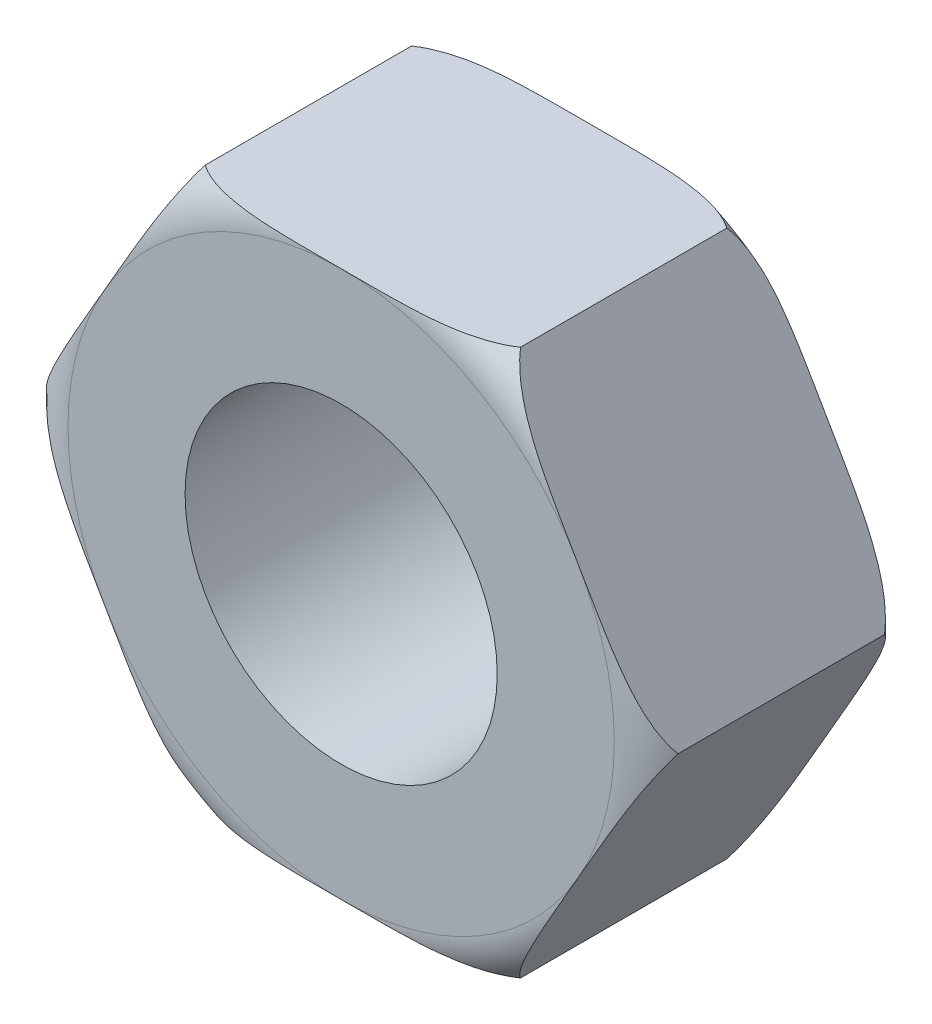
ISO-10303-21;
HEADER;
FILE_DESCRIPTION(('STEP AP214'),'2;1');
FILE_NAME('part.step','',(''),(''),'','','');
FILE_SCHEMA(('AUTOMOTIVE_DESIGN { 1 0 10303 214 1 1 1 1 }'));
ENDSEC;
DATA;
#1=APPLICATION_CONTEXT('core data for automotive mechanical design processes');
#2=APPLICATION_PROTOCOL_DEFINITION('international standard','automotive_design',2000,#1);
#3=PRODUCT_CONTEXT('',#1,'mechanical');
#4=PRODUCT('Part','Part','',(#3));
#5=PRODUCT_RELATED_PRODUCT_CATEGORY('part','',(#4));
#6=PRODUCT_DEFINITION_FORMATION('','',#4);
#7=PRODUCT_DEFINITION_CONTEXT('part definition',#1,'design');
#8=PRODUCT_DEFINITION('design','',#6,#7);
#9=PRODUCT_DEFINITION_SHAPE('','',#8);
#10=(LENGTH_UNIT() NAMED_UNIT(*) SI_UNIT(.MILLI.,.METRE.));
#11=(NAMED_UNIT(*) PLANE_ANGLE_UNIT() SI_UNIT($,.RADIAN.));
#12=(NAMED_UNIT(*) SI_UNIT($,.STERADIAN.) SOLID_ANGLE_UNIT());
#13=UNCERTAINTY_MEASURE_WITH_UNIT(LENGTH_MEASURE(1.E-05),#10,'distance_accuracy_value','');
#14=(GEOMETRIC_REPRESENTATION_CONTEXT(3) GLOBAL_UNCERTAINTY_ASSIGNED_CONTEXT((#13)) GLOBAL_UNIT_ASSIGNED_CONTEXT((#10,
#11,#12)) REPRESENTATION_CONTEXT('',''));
#15=CARTESIAN_POINT('',(0.,0.,0.));
#16=DIRECTION('',(0.,0.,1.));
#17=DIRECTION('',(1.,0.,0.));
#18=AXIS2_PLACEMENT_3D('',#15,#16,#17);
#19=CARTESIAN_POINT('',(-2.02072594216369,-3.5,3.2));
#20=DIRECTION('',(-0.866025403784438,-0.500000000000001,0.));
#21=DIRECTION('',(0.500000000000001,-0.866025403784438,0.));
#22=AXIS2_PLACEMENT_3D('',#19,#20,#21);
#23=PLANE('',#22);
#24=DIRECTION('',(0.,0.,-1.));
#25=VECTOR('',#24,1.);
#26=CARTESIAN_POINT('',(-2.02072594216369,-3.5,3.2));
#27=LINE('',#26,#25);
#28=CARTESIAN_POINT('',(-2.02072594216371,-3.5,2.92227330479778));
#29=VERTEX_POINT('',#28);
#30=CARTESIAN_POINT('',(-2.02072594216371,-3.5,0.27772669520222));
#31=VERTEX_POINT('',#30);
#32=EDGE_CURVE('E155',#29,#31,#27,.T.);
#33=ORIENTED_EDGE('',*,*,#32,.F.);
#34=CARTESIAN_POINT('',(-2.02061047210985,-3.5002,2.92211249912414));
#35=CARTESIAN_POINT('',(-2.03231964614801,-3.47991911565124,2.9384059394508));
#36=CARTESIAN_POINT('',(-2.04441562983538,-3.45896825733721,2.95351179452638));
#37=CARTESIAN_POINT('',(-2.06917957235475,-3.41607585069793,2.98158457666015));
#38=CARTESIAN_POINT('',(-2.08184615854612,-3.39413667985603,2.99455632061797));
#39=CARTESIAN_POINT('',(-2.12009292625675,-3.32789133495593,3.03035943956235));
#40=CARTESIAN_POINT('',(-2.14628573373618,-3.28252406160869,3.05055535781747));
#41=CARTESIAN_POINT('',(-2.2105700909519,-3.17118028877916,3.09272253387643));
#42=CARTESIAN_POINT('',(-2.24909220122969,-3.10445803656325,3.1119578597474));
#43=CARTESIAN_POINT('',(-2.3269027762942,-2.96968616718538,3.14291655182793));
#44=CARTESIAN_POINT('',(-2.36619260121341,-2.90163419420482,3.15462504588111));
#45=CARTESIAN_POINT('',(-2.44565873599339,-2.76399481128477,3.17302098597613));
#46=CARTESIAN_POINT('',(-2.48583937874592,-2.69439989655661,3.17962831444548));
#47=CARTESIAN_POINT('',(-2.56625940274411,-2.55510832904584,3.18940865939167));
#48=CARTESIAN_POINT('',(-2.60649870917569,-2.48541180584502,3.19258447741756));
#49=CARTESIAN_POINT('',(-2.67911341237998,-2.35963945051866,3.19651067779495));
#50=CARTESIAN_POINT('',(-2.71148489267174,-2.30357040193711,3.1976143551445));
#51=CARTESIAN_POINT('',(-2.77623259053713,-2.19142409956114,3.19909197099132));
#52=CARTESIAN_POINT('',(-2.80860880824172,-2.13534684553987,3.19946588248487));
#53=CARTESIAN_POINT('',(-2.87337024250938,-2.02317675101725,3.19989806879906));
#54=CARTESIAN_POINT('',(-2.90575545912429,-1.96708391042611,3.19995625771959));
#55=CARTESIAN_POINT('',(-2.97052510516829,-1.85489959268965,3.20000723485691));
#56=CARTESIAN_POINT('',(-3.0029095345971,-1.79880811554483,3.20000002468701));
#57=CARTESIAN_POINT('',(-3.06756935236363,-1.68681402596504,3.19999997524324));
#58=CARTESIAN_POINT('',(-3.09984474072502,-1.63091141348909,3.2000070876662));
#59=CARTESIAN_POINT('',(-3.16439641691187,-1.51910463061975,3.1999419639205));
#60=CARTESIAN_POINT('',(-3.19667270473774,-1.46320046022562,3.19986972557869));
#61=CARTESIAN_POINT('',(-3.26122028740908,-1.3514007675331,3.1993841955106));
#62=CARTESIAN_POINT('',(-3.29349158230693,-1.29550524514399,3.19897095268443));
#63=CARTESIAN_POINT('',(-3.35802893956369,-1.18372326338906,3.1973826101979));
#64=CARTESIAN_POINT('',(-3.39029500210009,-1.12783680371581,3.19620754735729));
#65=CARTESIAN_POINT('',(-3.45413616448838,-1.01726066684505,3.19256020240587));
#66=CARTESIAN_POINT('',(-3.48571161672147,-0.962570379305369,3.19011553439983));
#67=CARTESIAN_POINT('',(-3.54881385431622,-0.853274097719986,3.18326221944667));
#68=CARTESIAN_POINT('',(-3.58034063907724,-0.798668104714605,3.17885354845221));
#69=CARTESIAN_POINT('',(-3.64302473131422,-0.690096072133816,3.16727017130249));
#70=CARTESIAN_POINT('',(-3.67418300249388,-0.636128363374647,3.16011731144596));
#71=CARTESIAN_POINT('',(-3.73624428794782,-0.528635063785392,3.14201235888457));
#72=CARTESIAN_POINT('',(-3.76714725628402,-0.475109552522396,3.13105959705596));
#73=CARTESIAN_POINT('',(-3.81907300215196,-0.385171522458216,3.10814753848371));
#74=CARTESIAN_POINT('',(-3.84023946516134,-0.348510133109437,3.09750984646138));
#75=CARTESIAN_POINT('',(-3.88210504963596,-0.275996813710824,3.07321243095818));
#76=CARTESIAN_POINT('',(-3.90280485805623,-0.240143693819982,3.05955751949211));
#77=CARTESIAN_POINT('',(-3.94389546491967,-0.168972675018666,3.02824307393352));
#78=CARTESIAN_POINT('',(-3.96427350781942,-0.133676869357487,3.01051427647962));
#79=CARTESIAN_POINT('',(-3.99399571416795,-0.0821964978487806,2.98033005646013));
#80=CARTESIAN_POINT('',(-4.00378753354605,-0.0652365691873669,2.96963644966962));
#81=CARTESIAN_POINT('',(-4.02298985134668,-0.0319771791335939,2.94691066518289));
#82=CARTESIAN_POINT('',(-4.03239986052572,-0.0156785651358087,2.93487683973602));
#83=CARTESIAN_POINT('',(-4.04156735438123,0.000199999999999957,2.92211249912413));
#84=B_SPLINE_CURVE_WITH_KNOTS('',3,(#34,#35,#36,#37,#38,#39,#40,#41,#42,#43,#44,#45,#46,#47,#48,
#49,#50,#51,#52,#53,#54,#55,#56,#57,#58,#59,#60,#61,#62,#63,#64,#65,#66,#67,#68,#69,#70,#71,#72,
#73,#74,#75,#76,#77,#78,#79,#80,#81,#82,#83),.UNSPECIFIED.,.F.,.F.,(4,2,2,2,2,2,2,2,2,2,2,2,2,2,
2,2,2,2,2,2,2,2,2,2,4),(0.,0.0854868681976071,0.170778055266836,0.338769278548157,
0.576414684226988,0.814528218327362,1.05630943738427,1.29789311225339,1.49214442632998,
1.68640292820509,1.88071428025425,2.07502083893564,2.26867319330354,2.46233085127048,
2.65596074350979,2.84958127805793,3.03915673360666,3.22873451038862,3.4168333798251,
3.60496538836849,3.73582168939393,3.86647078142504,3.99953132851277,4.06642297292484,
4.13339778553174),.UNSPECIFIED.);
#85=CARTESIAN_POINT('',(-3.03108891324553,-1.75,3.2));
#86=VERTEX_POINT('',#85);
#87=EDGE_CURVE('E132',#29,#86,#84,.T.);
#88=ORIENTED_EDGE('',*,*,#87,.T.);
#89=CARTESIAN_POINT('',(-4.04145188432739,0.,2.92227330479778));
#90=VERTEX_POINT('',#89);
#91=EDGE_CURVE('E118',#86,#90,#84,.T.);
#92=ORIENTED_EDGE('',*,*,#91,.T.);
#93=DIRECTION('',(0.,0.,-1.));
#94=VECTOR('',#93,1.);
#95=CARTESIAN_POINT('',(-4.04145188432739,0.,3.2));
#96=LINE('',#95,#94);
#97=CARTESIAN_POINT('',(-4.04145188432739,0.,0.27772669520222));
#98=VERTEX_POINT('',#97);
#99=EDGE_CURVE('E130',#90,#98,#96,.T.);
#100=ORIENTED_EDGE('',*,*,#99,.T.);
#101=CARTESIAN_POINT('',(-4.04156735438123,0.000199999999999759,0.277887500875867));
#102=CARTESIAN_POINT('',(-4.02985818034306,-0.0200808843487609,0.261594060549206));
#103=CARTESIAN_POINT('',(-4.0177621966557,-0.0410317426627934,0.246488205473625));
#104=CARTESIAN_POINT('',(-3.99299825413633,-0.0839241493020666,0.218415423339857));
#105=CARTESIAN_POINT('',(-3.98033166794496,-0.105863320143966,0.205443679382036));
#106=CARTESIAN_POINT('',(-3.94208490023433,-0.172108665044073,0.169640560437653));
#107=CARTESIAN_POINT('',(-3.9158920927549,-0.217475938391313,0.149444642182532));
#108=CARTESIAN_POINT('',(-3.85160773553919,-0.328819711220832,0.107277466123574));
#109=CARTESIAN_POINT('',(-3.81308562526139,-0.395541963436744,0.0880421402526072));
#110=CARTESIAN_POINT('',(-3.73527505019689,-0.530313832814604,0.057083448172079));
#111=CARTESIAN_POINT('',(-3.69598522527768,-0.598365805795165,0.0453749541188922));
#112=CARTESIAN_POINT('',(-3.6165190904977,-0.736005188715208,0.0269790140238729));
#113=CARTESIAN_POINT('',(-3.57633844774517,-0.805600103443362,0.0203716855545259));
#114=CARTESIAN_POINT('',(-3.49591842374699,-0.944891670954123,0.0105913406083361));
#115=CARTESIAN_POINT('',(-3.45567911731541,-1.01458819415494,0.00741552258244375));
#116=CARTESIAN_POINT('',(-3.38306441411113,-1.1403605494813,0.00348932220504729));
#117=CARTESIAN_POINT('',(-3.35069293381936,-1.19642959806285,0.00238564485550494));
#118=CARTESIAN_POINT('',(-3.28594523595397,-1.30857590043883,0.000908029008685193));
#119=CARTESIAN_POINT('',(-3.25356901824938,-1.3646531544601,0.000534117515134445));
#120=CARTESIAN_POINT('',(-3.18880758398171,-1.47682324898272,0.000101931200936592));
#121=CARTESIAN_POINT('',(-3.15642236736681,-1.53291608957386,4.37422804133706E-05));
#122=CARTESIAN_POINT('',(-3.0916527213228,-1.64510040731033,-7.23485690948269E-06));
#123=CARTESIAN_POINT('',(-3.059268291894,-1.70119188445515,-2.46870103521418E-08));
#124=CARTESIAN_POINT('',(-2.99460847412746,-1.81318597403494,2.47567636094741E-08));
#125=CARTESIAN_POINT('',(-2.96233308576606,-1.86908858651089,-7.0876662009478E-06));
#126=CARTESIAN_POINT('',(-2.89778140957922,-1.98089536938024,5.80360794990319E-05));
#127=CARTESIAN_POINT('',(-2.86550512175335,-2.03679953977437,0.000130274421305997));
#128=CARTESIAN_POINT('',(-2.800957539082,-2.14859923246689,0.000615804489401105));
#129=CARTESIAN_POINT('',(-2.76868624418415,-2.20449475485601,0.00102904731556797));
#130=CARTESIAN_POINT('',(-2.70414888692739,-2.31627673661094,0.00261738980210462));
#131=CARTESIAN_POINT('',(-2.67188282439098,-2.37216319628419,0.0037924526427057));
#132=CARTESIAN_POINT('',(-2.6080416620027,-2.48273933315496,0.00743979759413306));
#133=CARTESIAN_POINT('',(-2.5764662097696,-2.53742962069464,0.00988446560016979));
#134=CARTESIAN_POINT('',(-2.51336397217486,-2.64672590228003,0.0167377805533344));
#135=CARTESIAN_POINT('',(-2.48183718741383,-2.70133189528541,0.0211464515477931));
#136=CARTESIAN_POINT('',(-2.41915309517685,-2.8099039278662,0.0327298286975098));
#137=CARTESIAN_POINT('',(-2.38799482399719,-2.86387163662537,0.0398826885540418));
#138=CARTESIAN_POINT('',(-2.32593353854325,-2.97136493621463,0.0579876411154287));
#139=CARTESIAN_POINT('',(-2.29503057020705,-3.02489044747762,0.0689404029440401));
#140=CARTESIAN_POINT('',(-2.24310482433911,-3.1148284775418,0.0918524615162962));
#141=CARTESIAN_POINT('',(-2.22193836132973,-3.15148986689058,0.102490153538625));
#142=CARTESIAN_POINT('',(-2.18007277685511,-3.22400318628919,0.126787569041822));
#143=CARTESIAN_POINT('',(-2.15937296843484,-3.25985630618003,0.140442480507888));
#144=CARTESIAN_POINT('',(-2.11828236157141,-3.33102732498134,0.17175692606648));
#145=CARTESIAN_POINT('',(-2.09790431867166,-3.36632313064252,0.189485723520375));
#146=CARTESIAN_POINT('',(-2.06818211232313,-3.41780350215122,0.219669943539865));
#147=CARTESIAN_POINT('',(-2.05839029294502,-3.43476343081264,0.230363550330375));
#148=CARTESIAN_POINT('',(-2.0391879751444,-3.46802282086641,0.253089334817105));
#149=CARTESIAN_POINT('',(-2.02977796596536,-3.48432143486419,0.265123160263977));
#150=CARTESIAN_POINT('',(-2.02061047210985,-3.5002,0.277887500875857));
#151=B_SPLINE_CURVE_WITH_KNOTS('',3,(#101,#102,#103,#104,#105,#106,#107,#108,#109,#110,#111,
#112,#113,#114,#115,#116,#117,#118,#119,#120,#121,#122,#123,#124,#125,#126,#127,#128,#129,#130,
#131,#132,#133,#134,#135,#136,#137,#138,#139,#140,#141,#142,#143,#144,#145,#146,#147,#148,#149,
#150),.UNSPECIFIED.,.F.,.F.,(4,2,2,2,2,2,2,2,2,2,2,2,2,2,2,2,2,2,2,2,2,2,2,2,4),(0.,
0.0854868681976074,0.170778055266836,0.338769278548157,0.576414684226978,0.81452821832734,
1.05630943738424,1.29789311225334,1.49214442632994,1.68640292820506,1.88071428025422,
2.07502083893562,2.26867319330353,2.46233085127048,2.65596074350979,2.84958127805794,
3.03915673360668,3.22873451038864,3.41683337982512,3.60496538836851,3.73582168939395,
3.86647078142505,3.99953132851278,4.06642297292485,4.13339778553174),.UNSPECIFIED.);
#152=CARTESIAN_POINT('',(-3.03108891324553,-1.75,0.));
#153=VERTEX_POINT('',#152);
#154=EDGE_CURVE('E388',#98,#153,#151,.T.);
#155=ORIENTED_EDGE('',*,*,#154,.T.);
#156=EDGE_CURVE('E280',#153,#31,#151,.T.);
#157=ORIENTED_EDGE('',*,*,#156,.T.);
#158=EDGE_LOOP('',(#33,#88,#92,#100,#155,#157));
#159=FACE_BOUND('',#158,.T.);
#160=ADVANCED_FACE('F26',(#159),#23,.T.);
#161=CARTESIAN_POINT('',(2.02072594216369,-3.5,3.2));
#162=DIRECTION('',(0.,-1.,0.));
#163=DIRECTION('',(0.,0.,-1.));
#164=AXIS2_PLACEMENT_3D('',#161,#162,#163);
#165=PLANE('',#164);
#166=CARTESIAN_POINT('',(0.,-3.5,3.2));
#167=CARTESIAN_POINT('',(-0.111150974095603,-3.5,3.20000668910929));
#168=CARTESIAN_POINT('',(-0.222302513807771,-3.5,3.20006579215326));
#169=CARTESIAN_POINT('',(-0.444673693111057,-3.5,3.1995572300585));
#170=CARTESIAN_POINT('',(-0.555893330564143,-3.5,3.19898916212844));
#171=CARTESIAN_POINT('',(-0.778504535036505,-3.5,3.19503905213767));
#172=CARTESIAN_POINT('',(-0.889896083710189,-3.5,3.19165237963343));
#173=CARTESIAN_POINT('',(-1.0566568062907,-3.5,3.18176260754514));
#174=CARTESIAN_POINT('',(-1.11215979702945,-3.5,3.1776678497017));
#175=CARTESIAN_POINT('',(-1.22295350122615,-3.5,3.1672698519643));
#176=CARTESIAN_POINT('',(-1.27824426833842,-3.5,3.16096721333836));
#177=CARTESIAN_POINT('',(-1.37961411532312,-3.5,3.14668144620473));
#178=CARTESIAN_POINT('',(-1.42575253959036,-3.5,3.13912814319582));
#179=CARTESIAN_POINT('',(-1.51752409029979,-3.5,3.12144292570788));
#180=CARTESIAN_POINT('',(-1.56315743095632,-3.5,3.11131215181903));
#181=CARTESIAN_POINT('',(-1.65336835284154,-3.5,3.08790534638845));
#182=CARTESIAN_POINT('',(-1.69795024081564,-3.5,3.07464622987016));
#183=CARTESIAN_POINT('',(-1.78573152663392,-3.5,3.04420504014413));
#184=CARTESIAN_POINT('',(-1.82893267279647,-3.5,3.02702817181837));
#185=CARTESIAN_POINT('',(-1.90175446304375,-3.5,2.99308371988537));
#186=CARTESIAN_POINT('',(-1.93189982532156,-3.5,2.97745112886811));
#187=CARTESIAN_POINT('',(-1.9904789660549,-3.5,2.94311283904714));
#188=CARTESIAN_POINT('',(-2.01891020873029,-3.5,2.92440273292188));
#189=CARTESIAN_POINT('',(-2.0734264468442,-3.5,2.88326406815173));
#190=CARTESIAN_POINT('',(-2.09948596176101,-3.5,2.86080114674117));
#191=CARTESIAN_POINT('',(-2.14757588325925,-3.5,2.8118990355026));
#192=CARTESIAN_POINT('',(-2.16961654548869,-3.5,2.78547028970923));
#193=CARTESIAN_POINT('',(-2.2015310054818,-3.5,2.73797000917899));
#194=CARTESIAN_POINT('',(-2.21302321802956,-3.5,2.71799031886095));
#195=CARTESIAN_POINT('',(-2.23267347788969,-3.5,2.67644140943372));
#196=CARTESIAN_POINT('',(-2.24083418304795,-3.5,2.65487347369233));
#197=CARTESIAN_POINT('',(-2.2532358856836,-3.5,2.61043512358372));
#198=CARTESIAN_POINT('',(-2.2574457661,-3.5,2.58755585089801));
#199=CARTESIAN_POINT('',(-2.26142275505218,-3.5,2.5414141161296));
#200=CARTESIAN_POINT('',(-2.26119196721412,-3.5,2.51815184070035));
#201=CARTESIAN_POINT('',(-2.25658348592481,-3.5,2.47458096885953));
#202=CARTESIAN_POINT('',(-2.25265281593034,-3.5,2.45422297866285));
#203=CARTESIAN_POINT('',(-2.24158543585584,-3.5,2.41440582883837));
#204=CARTESIAN_POINT('',(-2.23444753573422,-3.5,2.39494700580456));
#205=CARTESIAN_POINT('',(-2.21475916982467,-3.5,2.35141033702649));
#206=CARTESIAN_POINT('',(-2.20121510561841,-3.5,2.32778328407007));
#207=CARTESIAN_POINT('',(-2.17048923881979,-3.5,2.28303177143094));
#208=CARTESIAN_POINT('',(-2.15330024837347,-3.5,2.26191238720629));
#209=CARTESIAN_POINT('',(-2.10716989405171,-3.5,2.21245786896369));
#210=CARTESIAN_POINT('',(-2.07659633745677,-3.5,2.18565617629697));
#211=CARTESIAN_POINT('',(-2.01176301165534,-3.5,2.13701745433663));
#212=CARTESIAN_POINT('',(-1.97749567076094,-3.5,2.11519091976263));
#213=CARTESIAN_POINT('',(-1.91027461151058,-3.5,2.07774992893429));
#214=CARTESIAN_POINT('',(-1.87754249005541,-3.5,2.06172921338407));
#215=CARTESIAN_POINT('',(-1.81081153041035,-3.5,2.03254438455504));
#216=CARTESIAN_POINT('',(-1.77681156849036,-3.5,2.01938287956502));
#217=CARTESIAN_POINT('',(-1.70792827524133,-3.5,1.99546632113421));
#218=CARTESIAN_POINT('',(-1.67304364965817,-3.5,1.98471505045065));
#219=CARTESIAN_POINT('',(-1.60273714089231,-3.5,1.96527410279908));
#220=CARTESIAN_POINT('',(-1.56731560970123,-3.5,1.95658313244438));
#221=CARTESIAN_POINT('',(-1.46638608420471,-3.5,1.93439437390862));
#222=CARTESIAN_POINT('',(-1.40043153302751,-3.5,1.92293539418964));
#223=CARTESIAN_POINT('',(-1.26791377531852,-3.5,1.90422738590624));
#224=CARTESIAN_POINT('',(-1.20135008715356,-3.5,1.89698204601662));
#225=CARTESIAN_POINT('',(-1.06777034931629,-3.5,1.8854774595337));
#226=CARTESIAN_POINT('',(-1.00075353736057,-3.5,1.88122751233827));
#227=CARTESIAN_POINT('',(-0.866619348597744,-3.5,1.87477051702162));
#228=CARTESIAN_POINT('',(-0.799501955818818,-3.5,1.87256383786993));
#229=CARTESIAN_POINT('',(-0.66453271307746,-3.5,1.86940010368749));
#230=CARTESIAN_POINT('',(-0.596680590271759,-3.5,1.86845648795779));
#231=CARTESIAN_POINT('',(-0.460967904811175,-3.5,1.86724609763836));
#232=CARTESIAN_POINT('',(-0.393107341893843,-3.5,1.86697936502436));
#233=CARTESIAN_POINT('',(-0.257549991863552,-3.5,1.86669545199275));
#234=CARTESIAN_POINT('',(-0.189853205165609,-3.5,1.8666776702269));
#235=CARTESIAN_POINT('',(-0.054462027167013,-3.5,1.8666624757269));
#236=CARTESIAN_POINT('',(0.0132323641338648,-3.5,1.86666506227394));
#237=CARTESIAN_POINT('',(0.148067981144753,-3.5,1.8666695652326));
#238=CARTESIAN_POINT('',(0.215209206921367,-3.5,1.86667148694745));
#239=CARTESIAN_POINT('',(0.349495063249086,-3.5,1.86685579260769));
#240=CARTESIAN_POINT('',(0.416639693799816,-3.5,1.86703818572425));
#241=CARTESIAN_POINT('',(0.551138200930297,-3.5,1.86795866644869));
#242=CARTESIAN_POINT('',(0.618492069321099,-3.5,1.86869850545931));
#243=CARTESIAN_POINT('',(0.753174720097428,-3.5,1.87129730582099));
#244=CARTESIAN_POINT('',(0.820503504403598,-3.5,1.87315614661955));
#245=CARTESIAN_POINT('',(0.954200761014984,-3.5,1.87869854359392));
#246=CARTESIAN_POINT('',(1.02057015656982,-3.5,1.88235764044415));
#247=CARTESIAN_POINT('',(1.15310025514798,-3.5,1.89238784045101));
#248=CARTESIAN_POINT('',(1.2192610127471,-3.5,1.89875816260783));
#249=CARTESIAN_POINT('',(1.35081340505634,-3.5,1.91530131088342));
#250=CARTESIAN_POINT('',(1.4162071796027,-3.5,1.92545646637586));
#251=CARTESIAN_POINT('',(1.54594676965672,-3.5,1.95098182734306));
#252=CARTESIAN_POINT('',(1.61029393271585,-3.5,1.96634465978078));
#253=CARTESIAN_POINT('',(1.70292720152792,-3.5,1.99402400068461));
#254=CARTESIAN_POINT('',(1.73204648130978,-3.5,2.00355604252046));
#255=CARTESIAN_POINT('',(1.78967253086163,-3.5,2.02439819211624));
#256=CARTESIAN_POINT('',(1.81817886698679,-3.5,2.03570951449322));
#257=CARTESIAN_POINT('',(1.8742330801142,-3.5,2.06034297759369));
#258=CARTESIAN_POINT('',(1.90178319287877,-3.5,2.07365997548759));
#259=CARTESIAN_POINT('',(1.95561631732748,-3.5,2.10262095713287));
#260=CARTESIAN_POINT('',(1.98190044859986,-3.5,2.11826283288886));
#261=CARTESIAN_POINT('',(2.03338134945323,-3.5,2.15266647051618));
#262=CARTESIAN_POINT('',(2.05853100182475,-3.5,2.17149978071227));
#263=CARTESIAN_POINT('',(2.10615365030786,-3.5,2.21234156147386));
#264=CARTESIAN_POINT('',(2.12862767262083,-3.5,2.23434880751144));
#265=CARTESIAN_POINT('',(2.16627671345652,-3.5,2.27780269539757));
#266=CARTESIAN_POINT('',(2.18204392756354,-3.5,2.29873053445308));
#267=CARTESIAN_POINT('',(2.20997222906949,-3.5,2.3428752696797));
#268=CARTESIAN_POINT('',(2.22213918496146,-3.5,2.36608835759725));
#269=CARTESIAN_POINT('',(2.24003984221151,-3.5,2.409885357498));
#270=CARTESIAN_POINT('',(2.24655095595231,-3.5,2.43014963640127));
#271=CARTESIAN_POINT('',(2.25607887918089,-3.5,2.47148748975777));
#272=CARTESIAN_POINT('',(2.2590978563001,-3.5,2.49256055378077));
#273=CARTESIAN_POINT('',(2.26139619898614,-3.5,2.53496284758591));
#274=CARTESIAN_POINT('',(2.26066671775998,-3.5,2.55629256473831));
#275=CARTESIAN_POINT('',(2.25551115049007,-3.5,2.59849882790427));
#276=CARTESIAN_POINT('',(2.25108393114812,-3.5,2.61937523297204));
#277=CARTESIAN_POINT('',(2.23905277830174,-3.5,2.65955561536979));
#278=CARTESIAN_POINT('',(2.23153843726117,-3.5,2.67888690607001));
#279=CARTESIAN_POINT('',(2.21381913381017,-3.5,2.71626086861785));
#280=CARTESIAN_POINT('',(2.20361308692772,-3.5,2.73430301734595));
#281=CARTESIAN_POINT('',(2.17479443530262,-3.5,2.7784468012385));
#282=CARTESIAN_POINT('',(2.15464097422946,-3.5,2.80354260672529));
#283=CARTESIAN_POINT('',(2.11063392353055,-3.5,2.85024554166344));
#284=CARTESIAN_POINT('',(2.08677067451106,-3.5,2.8718432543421));
#285=CARTESIAN_POINT('',(2.02101389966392,-3.5,2.9241742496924));
#286=CARTESIAN_POINT('',(1.97707961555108,-3.5,2.95232301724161));
#287=CARTESIAN_POINT('',(1.88562338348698,-3.5,3.00186652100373));
#288=CARTESIAN_POINT('',(1.83809393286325,-3.5,3.02324662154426));
#289=CARTESIAN_POINT('',(1.72929104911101,-3.5,3.0652162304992));
#290=CARTESIAN_POINT('',(1.6674725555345,-3.5,3.0843653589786));
#291=CARTESIAN_POINT('',(1.5422395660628,-3.5,3.11661316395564));
#292=CARTESIAN_POINT('',(1.47882225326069,-3.5,3.12970024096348));
#293=CARTESIAN_POINT('',(1.35097932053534,-3.5,3.15141826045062));
#294=CARTESIAN_POINT('',(1.28655055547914,-3.5,3.16002997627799));
#295=CARTESIAN_POINT('',(1.15733035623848,-3.5,3.17395418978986));
#296=CARTESIAN_POINT('',(1.09253877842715,-3.5,3.17926527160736));
#297=CARTESIAN_POINT('',(0.942070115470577,-3.5,3.18890371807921));
#298=CARTESIAN_POINT('',(0.856341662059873,-3.5,3.19237300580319));
#299=CARTESIAN_POINT('',(0.684811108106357,-3.5,3.19704553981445));
#300=CARTESIAN_POINT('',(0.59900899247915,-3.5,3.19824802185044));
#301=CARTESIAN_POINT('',(0.427660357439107,-3.5,3.19964719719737));
#302=CARTESIAN_POINT('',(0.342113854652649,-3.5,3.19984693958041));
#303=CARTESIAN_POINT('',(0.171045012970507,-3.5,3.20002073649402));
#304=CARTESIAN_POINT('',(0.0855226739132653,-3.5,3.19999485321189));
#305=CARTESIAN_POINT('',(0.,-3.5,3.2));
#306=B_SPLINE_CURVE_WITH_KNOTS('',3,(#166,#167,#168,#169,#170,#171,#172,#173,#174,#175,#176,
#177,#178,#179,#180,#181,#182,#183,#184,#185,#186,#187,#188,#189,#190,#191,#192,#193,#194,#195,
#196,#197,#198,#199,#200,#201,#202,#203,#204,#205,#206,#207,#208,#209,#210,#211,#212,#213,#214,
#215,#216,#217,#218,#219,#220,#221,#222,#223,#224,#225,#226,#227,#228,#229,#230,#231,#232,#233,
#234,#235,#236,#237,#238,#239,#240,#241,#242,#243,#244,#245,#246,#247,#248,#249,#250,#251,#252,
#253,#254,#255,#256,#257,#258,#259,#260,#261,#262,#263,#264,#265,#266,#267,#268,#269,#270,#271,
#272,#273,#274,#275,#276,#277,#278,#279,#280,#281,#282,#283,#284,#285,#286,#287,#288,#289,#290,
#291,#292,#293,#294,#295,#296,#297,#298,#299,#300,#301,#302,#303,#304,#305),.UNSPECIFIED.,.T.,
.F.,(4,2,2,2,2,2,2,2,2,2,2,2,2,2,2,2,2,2,2,2,2,2,2,2,2,2,2,2,2,2,2,2,2,2,2,2,2,2,2,2,2,2,2,2,2,
2,2,2,2,2,2,2,2,2,2,2,2,2,2,2,2,2,2,2,2,2,2,2,2,4),(0.,0.333452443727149,0.667119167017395,
1.00133512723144,1.16826533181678,1.33515011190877,1.47535140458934,1.61549076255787,
1.75488908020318,1.89410326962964,1.99583489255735,2.0977134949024,2.20058196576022,
2.30318413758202,2.37208403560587,2.44092885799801,2.51031146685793,2.57966120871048,
2.64157958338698,2.70352095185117,2.78476930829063,2.86617940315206,2.98747074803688,
3.10901562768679,3.21818288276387,3.3274493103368,3.4368860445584,3.54625389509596,
3.74686430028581,3.94765005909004,4.14905645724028,4.35049921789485,4.55406877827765,
4.75765096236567,4.96074130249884,5.16382447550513,5.36524817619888,5.56668211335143,
5.7687515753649,5.97079927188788,6.1701746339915,6.36949260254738,6.56789142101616,
6.76601051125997,6.85788441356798,6.94982130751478,7.04152635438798,7.13314875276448,
7.22719338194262,7.32120182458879,7.3995293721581,7.47772853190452,7.54131025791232,
7.60485249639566,7.66854477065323,7.73225657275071,7.79423708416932,7.8562426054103,
7.9522498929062,8.04851148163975,8.20416179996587,8.36014641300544,8.55383660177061,
8.74789589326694,8.94278213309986,9.13775191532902,9.39508678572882,9.6525084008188,
9.90914678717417,10.1657144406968),.UNSPECIFIED.);
#307=CARTESIAN_POINT('',(2.02072594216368,-3.50000000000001,2.92227330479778));
#308=VERTEX_POINT('',#307);
#309=CARTESIAN_POINT('',(0.,-3.5,3.2));
#310=VERTEX_POINT('',#309);
#311=EDGE_CURVE('E183',#308,#310,#306,.T.);
#312=ORIENTED_EDGE('',*,*,#311,.T.);
#313=EDGE_CURVE('E185',#310,#29,#306,.T.);
#314=ORIENTED_EDGE('',*,*,#313,.T.);
#315=ORIENTED_EDGE('',*,*,#32,.T.);
#316=CARTESIAN_POINT('',(0.,-3.5,0.));
#317=CARTESIAN_POINT('',(0.111150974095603,-3.5,-6.68910928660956E-06));
#318=CARTESIAN_POINT('',(0.222302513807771,-3.5,-6.5792153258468E-05));
#319=CARTESIAN_POINT('',(0.444673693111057,-3.5,0.000442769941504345));
#320=CARTESIAN_POINT('',(0.555893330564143,-3.5,0.00101083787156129));
#321=CARTESIAN_POINT('',(0.778504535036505,-3.5,0.00496094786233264));
#322=CARTESIAN_POINT('',(0.889896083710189,-3.5,0.00834762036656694));
#323=CARTESIAN_POINT('',(1.0566568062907,-3.5,0.0182373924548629));
#324=CARTESIAN_POINT('',(1.11215979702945,-3.5,0.022332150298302));
#325=CARTESIAN_POINT('',(1.22295350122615,-3.5,0.0327301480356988));
#326=CARTESIAN_POINT('',(1.27824426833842,-3.5,0.0390327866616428));
#327=CARTESIAN_POINT('',(1.37961411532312,-3.5,0.0533185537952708));
#328=CARTESIAN_POINT('',(1.42575253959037,-3.5,0.0608718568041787));
#329=CARTESIAN_POINT('',(1.51752409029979,-3.5,0.0785570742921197));
#330=CARTESIAN_POINT('',(1.56315743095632,-3.5,0.0886878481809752));
#331=CARTESIAN_POINT('',(1.65336835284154,-3.5,0.112094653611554));
#332=CARTESIAN_POINT('',(1.69795024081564,-3.5,0.125353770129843));
#333=CARTESIAN_POINT('',(1.78573152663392,-3.5,0.155794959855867));
#334=CARTESIAN_POINT('',(1.82893267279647,-3.5,0.172971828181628));
#335=CARTESIAN_POINT('',(1.90175446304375,-3.5,0.206916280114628));
#336=CARTESIAN_POINT('',(1.93189982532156,-3.5,0.222548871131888));
#337=CARTESIAN_POINT('',(1.9904789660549,-3.5,0.256887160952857));
#338=CARTESIAN_POINT('',(2.01891020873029,-3.5,0.27559726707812));
#339=CARTESIAN_POINT('',(2.0734264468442,-3.5,0.316735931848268));
#340=CARTESIAN_POINT('',(2.09948596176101,-3.5,0.339198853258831));
#341=CARTESIAN_POINT('',(2.14757588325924,-3.5,0.388100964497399));
#342=CARTESIAN_POINT('',(2.16961654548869,-3.5,0.414529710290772));
#343=CARTESIAN_POINT('',(2.20153100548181,-3.5,0.46202999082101));
#344=CARTESIAN_POINT('',(2.21302321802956,-3.5,0.482009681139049));
#345=CARTESIAN_POINT('',(2.23267347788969,-3.5,0.523558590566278));
#346=CARTESIAN_POINT('',(2.24083418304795,-3.5,0.545126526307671));
#347=CARTESIAN_POINT('',(2.2532358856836,-3.5,0.589564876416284));
#348=CARTESIAN_POINT('',(2.2574457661,-3.5,0.612444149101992));
#349=CARTESIAN_POINT('',(2.26142275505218,-3.5,0.658585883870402));
#350=CARTESIAN_POINT('',(2.26119196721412,-3.5,0.681848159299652));
#351=CARTESIAN_POINT('',(2.25658348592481,-3.5,0.725419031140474));
#352=CARTESIAN_POINT('',(2.25265281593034,-3.5,0.745777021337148));
#353=CARTESIAN_POINT('',(2.24158543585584,-3.5,0.785594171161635));
#354=CARTESIAN_POINT('',(2.23444753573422,-3.5,0.805052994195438));
#355=CARTESIAN_POINT('',(2.21475916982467,-3.5,0.848589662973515));
#356=CARTESIAN_POINT('',(2.20121510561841,-3.5,0.872216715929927));
#357=CARTESIAN_POINT('',(2.17048923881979,-3.5,0.916968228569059));
#358=CARTESIAN_POINT('',(2.15330024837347,-3.5,0.93808761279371));
#359=CARTESIAN_POINT('',(2.10716989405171,-3.5,0.987542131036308));
#360=CARTESIAN_POINT('',(2.07659633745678,-3.5,1.01434382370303));
#361=CARTESIAN_POINT('',(2.01176301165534,-3.5,1.06298254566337));
#362=CARTESIAN_POINT('',(1.97749567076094,-3.5,1.08480908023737));
#363=CARTESIAN_POINT('',(1.91027461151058,-3.5,1.12225007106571));
#364=CARTESIAN_POINT('',(1.87754249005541,-3.5,1.13827078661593));
#365=CARTESIAN_POINT('',(1.81081153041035,-3.5,1.16745561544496));
#366=CARTESIAN_POINT('',(1.77681156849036,-3.5,1.18061712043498));
#367=CARTESIAN_POINT('',(1.70792827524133,-3.5,1.20453367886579));
#368=CARTESIAN_POINT('',(1.67304364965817,-3.5,1.21528494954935));
#369=CARTESIAN_POINT('',(1.60273714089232,-3.5,1.23472589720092));
#370=CARTESIAN_POINT('',(1.56731560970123,-3.5,1.24341686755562));
#371=CARTESIAN_POINT('',(1.46638608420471,-3.5,1.26560562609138));
#372=CARTESIAN_POINT('',(1.40043153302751,-3.5,1.27706460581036));
#373=CARTESIAN_POINT('',(1.26791377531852,-3.5,1.29577261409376));
#374=CARTESIAN_POINT('',(1.20135008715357,-3.5,1.30301795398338));
#375=CARTESIAN_POINT('',(1.06777034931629,-3.5,1.3145225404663));
#376=CARTESIAN_POINT('',(1.00075353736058,-3.5,1.31877248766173));
#377=CARTESIAN_POINT('',(0.866619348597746,-3.5,1.32522948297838));
#378=CARTESIAN_POINT('',(0.799501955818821,-3.5,1.32743616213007));
#379=CARTESIAN_POINT('',(0.664532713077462,-3.5,1.33059989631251));
#380=CARTESIAN_POINT('',(0.596680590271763,-3.5,1.33154351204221));
#381=CARTESIAN_POINT('',(0.460967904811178,-3.5,1.33275390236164));
#382=CARTESIAN_POINT('',(0.393107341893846,-3.5,1.33302063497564));
#383=CARTESIAN_POINT('',(0.257549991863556,-3.5,1.33330454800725));
#384=CARTESIAN_POINT('',(0.189853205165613,-3.5,1.3333223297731));
#385=CARTESIAN_POINT('',(0.0544620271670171,-3.5,1.3333375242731));
#386=CARTESIAN_POINT('',(-0.0132323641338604,-3.5,1.33333493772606));
#387=CARTESIAN_POINT('',(-0.148067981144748,-3.5,1.3333304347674));
#388=CARTESIAN_POINT('',(-0.215209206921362,-3.5,1.33332851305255));
#389=CARTESIAN_POINT('',(-0.349495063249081,-3.5,1.33314420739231));
#390=CARTESIAN_POINT('',(-0.41663969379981,-3.5,1.33296181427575));
#391=CARTESIAN_POINT('',(-0.551138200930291,-3.5,1.33204133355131));
#392=CARTESIAN_POINT('',(-0.618492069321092,-3.5,1.33130149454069));
#393=CARTESIAN_POINT('',(-0.753174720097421,-3.5,1.32870269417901));
#394=CARTESIAN_POINT('',(-0.820503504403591,-3.5,1.32684385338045));
#395=CARTESIAN_POINT('',(-0.954200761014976,-3.5,1.32130145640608));
#396=CARTESIAN_POINT('',(-1.02057015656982,-3.5,1.31764235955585));
#397=CARTESIAN_POINT('',(-1.15310025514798,-3.5,1.30761215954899));
#398=CARTESIAN_POINT('',(-1.21926101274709,-3.5,1.30124183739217));
#399=CARTESIAN_POINT('',(-1.35081340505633,-3.5,1.28469868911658));
#400=CARTESIAN_POINT('',(-1.4162071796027,-3.5,1.27454353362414));
#401=CARTESIAN_POINT('',(-1.54594676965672,-3.5,1.24901817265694));
#402=CARTESIAN_POINT('',(-1.61029393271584,-3.5,1.23365534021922));
#403=CARTESIAN_POINT('',(-1.70292720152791,-3.5,1.20597599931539));
#404=CARTESIAN_POINT('',(-1.73204648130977,-3.5,1.19644395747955));
#405=CARTESIAN_POINT('',(-1.78967253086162,-3.5,1.17560180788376));
#406=CARTESIAN_POINT('',(-1.81817886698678,-3.5,1.16429048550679));
#407=CARTESIAN_POINT('',(-1.87423308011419,-3.5,1.13965702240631));
#408=CARTESIAN_POINT('',(-1.90178319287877,-3.5,1.12634002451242));
#409=CARTESIAN_POINT('',(-1.95561631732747,-3.5,1.09737904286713));
#410=CARTESIAN_POINT('',(-1.98190044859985,-3.5,1.08173716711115));
#411=CARTESIAN_POINT('',(-2.03338134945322,-3.5,1.04733352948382));
#412=CARTESIAN_POINT('',(-2.05853100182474,-3.5,1.02850021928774));
#413=CARTESIAN_POINT('',(-2.10615365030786,-3.5,0.987658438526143));
#414=CARTESIAN_POINT('',(-2.12862767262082,-3.5,0.965651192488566));
#415=CARTESIAN_POINT('',(-2.16627671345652,-3.5,0.922197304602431));
#416=CARTESIAN_POINT('',(-2.18204392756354,-3.5,0.901269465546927));
#417=CARTESIAN_POINT('',(-2.20997222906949,-3.5,0.857124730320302));
#418=CARTESIAN_POINT('',(-2.22213918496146,-3.5,0.833911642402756));
#419=CARTESIAN_POINT('',(-2.24003984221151,-3.5,0.790114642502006));
#420=CARTESIAN_POINT('',(-2.24655095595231,-3.5,0.769850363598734));
#421=CARTESIAN_POINT('',(-2.25607887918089,-3.5,0.728512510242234));
#422=CARTESIAN_POINT('',(-2.2590978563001,-3.5,0.707439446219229));
#423=CARTESIAN_POINT('',(-2.26139619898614,-3.5,0.665037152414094));
#424=CARTESIAN_POINT('',(-2.26066671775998,-3.5,0.643707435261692));
#425=CARTESIAN_POINT('',(-2.25551115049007,-3.5,0.60150117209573));
#426=CARTESIAN_POINT('',(-2.25108393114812,-3.5,0.580624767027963));
#427=CARTESIAN_POINT('',(-2.23905277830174,-3.5,0.540444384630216));
#428=CARTESIAN_POINT('',(-2.23153843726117,-3.5,0.521113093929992));
#429=CARTESIAN_POINT('',(-2.21381913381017,-3.5,0.483739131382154));
#430=CARTESIAN_POINT('',(-2.20361308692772,-3.5,0.465696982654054));
#431=CARTESIAN_POINT('',(-2.17479443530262,-3.5,0.421553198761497));
#432=CARTESIAN_POINT('',(-2.15464097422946,-3.5,0.39645739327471));
#433=CARTESIAN_POINT('',(-2.11063392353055,-3.5,0.349754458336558));
#434=CARTESIAN_POINT('',(-2.08677067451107,-3.5,0.328156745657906));
#435=CARTESIAN_POINT('',(-2.02101389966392,-3.5,0.275825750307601));
#436=CARTESIAN_POINT('',(-1.97707961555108,-3.5,0.247676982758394));
#437=CARTESIAN_POINT('',(-1.88562338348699,-3.5,0.198133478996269));
#438=CARTESIAN_POINT('',(-1.83809393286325,-3.5,0.176753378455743));
#439=CARTESIAN_POINT('',(-1.72929104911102,-3.5,0.134783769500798));
#440=CARTESIAN_POINT('',(-1.66747255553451,-3.5,0.1156346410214));
#441=CARTESIAN_POINT('',(-1.54223956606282,-3.5,0.0833868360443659));
#442=CARTESIAN_POINT('',(-1.4788222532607,-3.5,0.0702997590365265));
#443=CARTESIAN_POINT('',(-1.35097932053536,-3.5,0.0485817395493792));
#444=CARTESIAN_POINT('',(-1.28655055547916,-3.5,0.039970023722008));
#445=CARTESIAN_POINT('',(-1.1573303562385,-3.5,0.0260458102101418));
#446=CARTESIAN_POINT('',(-1.09253877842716,-3.5,0.0207347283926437));
#447=CARTESIAN_POINT('',(-0.942070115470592,-3.5,0.0110962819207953));
#448=CARTESIAN_POINT('',(-0.856341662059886,-3.5,0.00762699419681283));
#449=CARTESIAN_POINT('',(-0.684811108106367,-3.5,0.00295446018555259));
#450=CARTESIAN_POINT('',(-0.599008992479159,-3.5,0.00175197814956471));
#451=CARTESIAN_POINT('',(-0.427660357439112,-3.5,0.000352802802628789));
#452=CARTESIAN_POINT('',(-0.342113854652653,-3.5,0.000153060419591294));
#453=CARTESIAN_POINT('',(-0.171045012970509,-3.5,-2.07364940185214E-05));
#454=CARTESIAN_POINT('',(-0.0855226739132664,-3.5,5.14678811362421E-06));
#455=CARTESIAN_POINT('',(0.,-3.5,0.));
#456=B_SPLINE_CURVE_WITH_KNOTS('',3,(#316,#317,#318,#319,#320,#321,#322,#323,#324,#325,#326,
#327,#328,#329,#330,#331,#332,#333,#334,#335,#336,#337,#338,#339,#340,#341,#342,#343,#344,#345,
#346,#347,#348,#349,#350,#351,#352,#353,#354,#355,#356,#357,#358,#359,#360,#361,#362,#363,#364,
#365,#366,#367,#368,#369,#370,#371,#372,#373,#374,#375,#376,#377,#378,#379,#380,#381,#382,#383,
#384,#385,#386,#387,#388,#389,#390,#391,#392,#393,#394,#395,#396,#397,#398,#399,#400,#401,#402,
#403,#404,#405,#406,#407,#408,#409,#410,#411,#412,#413,#414,#415,#416,#417,#418,#419,#420,#421,
#422,#423,#424,#425,#426,#427,#428,#429,#430,#431,#432,#433,#434,#435,#436,#437,#438,#439,#440,
#441,#442,#443,#444,#445,#446,#447,#448,#449,#450,#451,#452,#453,#454,#455),.UNSPECIFIED.,.T.,
.F.,(4,2,2,2,2,2,2,2,2,2,2,2,2,2,2,2,2,2,2,2,2,2,2,2,2,2,2,2,2,2,2,2,2,2,2,2,2,2,2,2,2,2,2,2,2,
2,2,2,2,2,2,2,2,2,2,2,2,2,2,2,2,2,2,2,2,2,2,2,2,4),(0.,0.333452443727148,0.667119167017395,
1.00133512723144,1.16826533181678,1.33515011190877,1.47535140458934,1.61549076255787,
1.75488908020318,1.89410326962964,1.99583489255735,2.0977134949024,2.20058196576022,
2.30318413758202,2.37208403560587,2.44092885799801,2.51031146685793,2.57966120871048,
2.64157958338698,2.70352095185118,2.78476930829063,2.86617940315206,2.98747074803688,
3.10901562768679,3.21818288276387,3.3274493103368,3.4368860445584,3.54625389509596,
3.74686430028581,3.94765005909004,4.14905645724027,4.35049921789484,4.55406877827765,
4.75765096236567,4.96074130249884,5.16382447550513,5.36524817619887,5.56668211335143,
5.76875157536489,5.97079927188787,6.17017463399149,6.36949260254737,6.56789142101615,
6.76601051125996,6.85788441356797,6.94982130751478,7.04152635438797,7.13314875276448,
7.22719338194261,7.32120182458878,7.3995293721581,7.47772853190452,7.54131025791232,
7.60485249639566,7.66854477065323,7.73225657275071,7.79423708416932,7.8562426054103,
7.95224989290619,8.04851148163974,8.20416179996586,8.36014641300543,8.5538366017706,
8.74789589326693,8.94278213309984,9.13775191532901,9.3950867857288,9.65250840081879,
9.90914678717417,10.1657144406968),.UNSPECIFIED.);
#457=CARTESIAN_POINT('',(0.,-3.5,0.));
#458=VERTEX_POINT('',#457);
#459=EDGE_CURVE('E281',#31,#458,#456,.T.);
#460=ORIENTED_EDGE('',*,*,#459,.T.);
#461=CARTESIAN_POINT('',(2.02072594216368,-3.50000000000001,0.27772669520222));
#462=VERTEX_POINT('',#461);
#463=EDGE_CURVE('E276',#458,#462,#456,.T.);
#464=ORIENTED_EDGE('',*,*,#463,.T.);
#465=DIRECTION('',(0.,0.,-1.));
#466=VECTOR('',#465,1.);
#467=CARTESIAN_POINT('',(2.02072594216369,-3.5,3.2));
#468=LINE('',#467,#466);
#469=EDGE_CURVE('E187',#308,#462,#468,.T.);
#470=ORIENTED_EDGE('',*,*,#469,.F.);
#471=EDGE_LOOP('',(#312,#314,#315,#460,#464,#470));
#472=FACE_BOUND('',#471,.T.);
#473=ADVANCED_FACE('F184',(#472),#165,.T.);
#474=CARTESIAN_POINT('',(4.04145188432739,0.,3.2));
#475=DIRECTION('',(0.866025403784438,-0.500000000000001,0.));
#476=DIRECTION('',(0.500000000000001,0.866025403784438,0.));
#477=AXIS2_PLACEMENT_3D('',#474,#475,#476);
#478=PLANE('',#477);
#479=DIRECTION('',(0.,0.,-1.));
#480=VECTOR('',#479,1.);
#481=CARTESIAN_POINT('',(4.04145188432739,0.,3.2));
#482=LINE('',#481,#480);
#483=CARTESIAN_POINT('',(4.04145188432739,0.,2.92227330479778));
#484=VERTEX_POINT('',#483);
#485=CARTESIAN_POINT('',(4.04145188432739,0.,0.27772669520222));
#486=VERTEX_POINT('',#485);
#487=EDGE_CURVE('E419',#484,#486,#482,.T.);
#488=ORIENTED_EDGE('',*,*,#487,.F.);
#489=CARTESIAN_POINT('',(4.04156735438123,0.00019999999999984,2.92211249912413));
#490=CARTESIAN_POINT('',(4.02985818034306,-0.0200808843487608,2.93840593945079));
#491=CARTESIAN_POINT('',(4.01776219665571,-0.0410317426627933,2.95351179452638));
#492=CARTESIAN_POINT('',(3.99299825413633,-0.0839241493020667,2.98158457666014));
#493=CARTESIAN_POINT('',(3.98033166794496,-0.105863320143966,2.99455632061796));
#494=CARTESIAN_POINT('',(3.94208490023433,-0.172108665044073,3.03035943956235));
#495=CARTESIAN_POINT('',(3.9158920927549,-0.217475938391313,3.05055535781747));
#496=CARTESIAN_POINT('',(3.85160773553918,-0.328819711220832,3.09272253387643));
#497=CARTESIAN_POINT('',(3.81308562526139,-0.395541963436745,3.11195785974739));
#498=CARTESIAN_POINT('',(3.73527505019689,-0.530313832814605,3.14291655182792));
#499=CARTESIAN_POINT('',(3.69598522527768,-0.598365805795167,3.15462504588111));
#500=CARTESIAN_POINT('',(3.6165190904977,-0.73600518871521,3.17302098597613));
#501=CARTESIAN_POINT('',(3.57633844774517,-0.805600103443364,3.17962831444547));
#502=CARTESIAN_POINT('',(3.49591842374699,-0.944891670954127,3.18940865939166));
#503=CARTESIAN_POINT('',(3.45567911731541,-1.01458819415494,3.19258447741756));
#504=CARTESIAN_POINT('',(3.38306441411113,-1.1403605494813,3.19651067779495));
#505=CARTESIAN_POINT('',(3.35069293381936,-1.19642959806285,3.1976143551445));
#506=CARTESIAN_POINT('',(3.28594523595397,-1.30857590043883,3.19909197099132));
#507=CARTESIAN_POINT('',(3.25356901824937,-1.3646531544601,3.19946588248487));
#508=CARTESIAN_POINT('',(3.18880758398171,-1.47682324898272,3.19989806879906));
#509=CARTESIAN_POINT('',(3.15642236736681,-1.53291608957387,3.19995625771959));
#510=CARTESIAN_POINT('',(3.0916527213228,-1.64510040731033,3.20000723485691));
#511=CARTESIAN_POINT('',(3.059268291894,-1.70119188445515,3.20000002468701));
#512=CARTESIAN_POINT('',(2.99460847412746,-1.81318597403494,3.19999997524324));
#513=CARTESIAN_POINT('',(2.96233308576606,-1.86908858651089,3.2000070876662));
#514=CARTESIAN_POINT('',(2.89778140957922,-1.98089536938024,3.1999419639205));
#515=CARTESIAN_POINT('',(2.86550512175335,-2.03679953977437,3.19986972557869));
#516=CARTESIAN_POINT('',(2.800957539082,-2.14859923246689,3.1993841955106));
#517=CARTESIAN_POINT('',(2.76868624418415,-2.20449475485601,3.19897095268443));
#518=CARTESIAN_POINT('',(2.70414888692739,-2.31627673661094,3.1973826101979));
#519=CARTESIAN_POINT('',(2.67188282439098,-2.37216319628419,3.19620754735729));
#520=CARTESIAN_POINT('',(2.6080416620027,-2.48273933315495,3.19256020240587));
#521=CARTESIAN_POINT('',(2.57646620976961,-2.53742962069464,3.19011553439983));
#522=CARTESIAN_POINT('',(2.51336397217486,-2.64672590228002,3.18326221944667));
#523=CARTESIAN_POINT('',(2.48183718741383,-2.70133189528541,3.17885354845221));
#524=CARTESIAN_POINT('',(2.41915309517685,-2.8099039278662,3.16727017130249));
#525=CARTESIAN_POINT('',(2.38799482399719,-2.86387163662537,3.16011731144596));
#526=CARTESIAN_POINT('',(2.32593353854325,-2.97136493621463,3.14201235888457));
#527=CARTESIAN_POINT('',(2.29503057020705,-3.02489044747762,3.13105959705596));
#528=CARTESIAN_POINT('',(2.24310482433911,-3.1148284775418,3.1081475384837));
#529=CARTESIAN_POINT('',(2.22193836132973,-3.15148986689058,3.09750984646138));
#530=CARTESIAN_POINT('',(2.18007277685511,-3.22400318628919,3.07321243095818));
#531=CARTESIAN_POINT('',(2.15937296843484,-3.25985630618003,3.05955751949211));
#532=CARTESIAN_POINT('',(2.11828236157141,-3.33102732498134,3.02824307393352));
#533=CARTESIAN_POINT('',(2.09790431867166,-3.36632313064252,3.01051427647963));
#534=CARTESIAN_POINT('',(2.06818211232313,-3.41780350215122,2.98033005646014));
#535=CARTESIAN_POINT('',(2.05839029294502,-3.43476343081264,2.96963644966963));
#536=CARTESIAN_POINT('',(2.0391879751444,-3.46802282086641,2.9469106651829));
#537=CARTESIAN_POINT('',(2.02977796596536,-3.48432143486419,2.93487683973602));
#538=CARTESIAN_POINT('',(2.02061047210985,-3.5002,2.92211249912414));
#539=B_SPLINE_CURVE_WITH_KNOTS('',3,(#489,#490,#491,#492,#493,#494,#495,#496,#497,#498,#499,
#500,#501,#502,#503,#504,#505,#506,#507,#508,#509,#510,#511,#512,#513,#514,#515,#516,#517,#518,
#519,#520,#521,#522,#523,#524,#525,#526,#527,#528,#529,#530,#531,#532,#533,#534,#535,#536,#537,
#538),.UNSPECIFIED.,.F.,.F.,(4,2,2,2,2,2,2,2,2,2,2,2,2,2,2,2,2,2,2,2,2,2,2,2,4),(0.,
0.0854868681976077,0.170778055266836,0.338769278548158,0.576414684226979,0.814528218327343,
1.05630943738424,1.29789311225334,1.49214442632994,1.68640292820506,1.88071428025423,
2.07502083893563,2.26867319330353,2.46233085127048,2.65596074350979,2.84958127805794,
3.03915673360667,3.22873451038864,3.41683337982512,3.60496538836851,3.73582168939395,
3.86647078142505,3.99953132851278,4.06642297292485,4.13339778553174),.UNSPECIFIED.);
#540=CARTESIAN_POINT('',(3.03108891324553,-1.75,3.2));
#541=VERTEX_POINT('',#540);
#542=EDGE_CURVE('E196',#484,#541,#539,.T.);
#543=ORIENTED_EDGE('',*,*,#542,.T.);
#544=EDGE_CURVE('E191',#541,#308,#539,.T.);
#545=ORIENTED_EDGE('',*,*,#544,.T.);
#546=ORIENTED_EDGE('',*,*,#469,.T.);
#547=CARTESIAN_POINT('',(2.02061047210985,-3.5002,0.277887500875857));
#548=CARTESIAN_POINT('',(2.03231964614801,-3.47991911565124,0.261594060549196));
#549=CARTESIAN_POINT('',(2.04441562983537,-3.45896825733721,0.246488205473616));
#550=CARTESIAN_POINT('',(2.06917957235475,-3.41607585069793,0.218415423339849));
#551=CARTESIAN_POINT('',(2.08184615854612,-3.39413667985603,0.205443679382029));
#552=CARTESIAN_POINT('',(2.12009292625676,-3.32789133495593,0.169640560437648));
#553=CARTESIAN_POINT('',(2.14628573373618,-3.28252406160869,0.149444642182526));
#554=CARTESIAN_POINT('',(2.2105700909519,-3.17118028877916,0.107277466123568));
#555=CARTESIAN_POINT('',(2.24909220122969,-3.10445803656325,0.0880421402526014));
#556=CARTESIAN_POINT('',(2.3269027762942,-2.96968616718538,0.0570834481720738));
#557=CARTESIAN_POINT('',(2.36619260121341,-2.90163419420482,0.0453749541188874));
#558=CARTESIAN_POINT('',(2.44565873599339,-2.76399481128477,0.0269790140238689));
#559=CARTESIAN_POINT('',(2.48583937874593,-2.69439989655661,0.0203716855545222));
#560=CARTESIAN_POINT('',(2.56625940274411,-2.55510832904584,0.0105913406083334));
#561=CARTESIAN_POINT('',(2.60649870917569,-2.48541180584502,0.0074155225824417));
#562=CARTESIAN_POINT('',(2.67911341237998,-2.35963945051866,0.0034893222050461));
#563=CARTESIAN_POINT('',(2.71148489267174,-2.30357040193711,0.00238564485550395));
#564=CARTESIAN_POINT('',(2.77623259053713,-2.19142409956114,0.000908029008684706));
#565=CARTESIAN_POINT('',(2.80860880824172,-2.13534684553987,0.000534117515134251));
#566=CARTESIAN_POINT('',(2.87337024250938,-2.02317675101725,0.000101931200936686));
#567=CARTESIAN_POINT('',(2.90575545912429,-1.96708391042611,4.37422804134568E-05));
#568=CARTESIAN_POINT('',(2.97052510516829,-1.85489959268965,-7.23485690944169E-06));
#569=CARTESIAN_POINT('',(3.0029095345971,-1.79880811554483,-2.46870103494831E-08));
#570=CARTESIAN_POINT('',(3.06756935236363,-1.68681402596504,2.47567636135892E-08));
#571=CARTESIAN_POINT('',(3.09984474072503,-1.63091141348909,-7.08766620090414E-06));
#572=CARTESIAN_POINT('',(3.16439641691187,-1.51910463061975,5.803607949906E-05));
#573=CARTESIAN_POINT('',(3.19667270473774,-1.46320046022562,0.000130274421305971));
#574=CARTESIAN_POINT('',(3.26122028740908,-1.3514007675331,0.000615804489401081));
#575=CARTESIAN_POINT('',(3.29349158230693,-1.29550524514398,0.00102904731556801));
#576=CARTESIAN_POINT('',(3.35802893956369,-1.18372326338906,0.00261738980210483));
#577=CARTESIAN_POINT('',(3.39029500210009,-1.12783680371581,0.00379245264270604));
#578=CARTESIAN_POINT('',(3.45413616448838,-1.01726066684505,0.00743979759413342));
#579=CARTESIAN_POINT('',(3.48571161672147,-0.962570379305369,0.00988446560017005));
#580=CARTESIAN_POINT('',(3.54881385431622,-0.853274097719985,0.0167377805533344));
#581=CARTESIAN_POINT('',(3.58034063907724,-0.798668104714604,0.021146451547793));
#582=CARTESIAN_POINT('',(3.64302473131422,-0.690096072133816,0.0327298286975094));
#583=CARTESIAN_POINT('',(3.67418300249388,-0.636128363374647,0.0398826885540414));
#584=CARTESIAN_POINT('',(3.73624428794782,-0.528635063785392,0.0579876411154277));
#585=CARTESIAN_POINT('',(3.76714725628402,-0.475109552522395,0.0689404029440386));
#586=CARTESIAN_POINT('',(3.81907300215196,-0.385171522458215,0.0918524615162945));
#587=CARTESIAN_POINT('',(3.84023946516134,-0.348510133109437,0.102490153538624));
#588=CARTESIAN_POINT('',(3.88210504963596,-0.275996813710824,0.126787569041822));
#589=CARTESIAN_POINT('',(3.90280485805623,-0.240143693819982,0.140442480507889));
#590=CARTESIAN_POINT('',(3.94389546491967,-0.168972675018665,0.171756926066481));
#591=CARTESIAN_POINT('',(3.96427350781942,-0.133676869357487,0.189485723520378));
#592=CARTESIAN_POINT('',(3.99399571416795,-0.0821964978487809,0.21966994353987));
#593=CARTESIAN_POINT('',(4.00378753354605,-0.065236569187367,0.23036355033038));
#594=CARTESIAN_POINT('',(4.02298985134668,-0.0319771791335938,0.253089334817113));
#595=CARTESIAN_POINT('',(4.03239986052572,-0.0156785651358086,0.265123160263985));
#596=CARTESIAN_POINT('',(4.04156735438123,0.000200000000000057,0.277887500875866));
#597=B_SPLINE_CURVE_WITH_KNOTS('',3,(#547,#548,#549,#550,#551,#552,#553,#554,#555,#556,#557,
#558,#559,#560,#561,#562,#563,#564,#565,#566,#567,#568,#569,#570,#571,#572,#573,#574,#575,#576,
#577,#578,#579,#580,#581,#582,#583,#584,#585,#586,#587,#588,#589,#590,#591,#592,#593,#594,#595,
#596),.UNSPECIFIED.,.F.,.F.,(4,2,2,2,2,2,2,2,2,2,2,2,2,2,2,2,2,2,2,2,2,2,2,2,4),(0.,
0.0854868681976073,0.170778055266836,0.338769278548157,0.576414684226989,0.814528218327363,
1.05630943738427,1.29789311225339,1.49214442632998,1.68640292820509,1.88071428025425,
2.07502083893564,2.26867319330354,2.46233085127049,2.65596074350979,2.84958127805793,
3.03915673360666,3.22873451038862,3.4168333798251,3.60496538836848,3.73582168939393,
3.86647078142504,3.99953132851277,4.06642297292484,4.13339778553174),.UNSPECIFIED.);
#598=CARTESIAN_POINT('',(3.03108891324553,-1.75,0.));
#599=VERTEX_POINT('',#598);
#600=EDGE_CURVE('E275',#462,#599,#597,.T.);
#601=ORIENTED_EDGE('',*,*,#600,.T.);
#602=EDGE_CURVE('E269',#599,#486,#597,.T.);
#603=ORIENTED_EDGE('',*,*,#602,.T.);
#604=EDGE_LOOP('',(#488,#543,#545,#546,#601,#603));
#605=FACE_BOUND('',#604,.T.);
#606=ADVANCED_FACE('F212',(#605),#478,.T.);
#607=CARTESIAN_POINT('',(2.02072594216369,3.5,3.2));
#608=DIRECTION('',(0.866025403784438,0.500000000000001,0.));
#609=DIRECTION('',(-0.500000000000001,0.866025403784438,0.));
#610=AXIS2_PLACEMENT_3D('',#607,#608,#609);
#611=PLANE('',#610);
#612=DIRECTION('',(0.,0.,-1.));
#613=VECTOR('',#612,1.);
#614=CARTESIAN_POINT('',(2.02072594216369,3.5,3.2));
#615=LINE('',#614,#613);
#616=CARTESIAN_POINT('',(2.02072594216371,3.5,2.92227330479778));
#617=VERTEX_POINT('',#616);
#618=CARTESIAN_POINT('',(2.02072594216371,3.5,0.27772669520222));
#619=VERTEX_POINT('',#618);
#620=EDGE_CURVE('E143',#617,#619,#615,.T.);
#621=ORIENTED_EDGE('',*,*,#620,.F.);
#622=CARTESIAN_POINT('',(2.02059603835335,3.50022499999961,2.92209239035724));
#623=CARTESIAN_POINT('',(2.03230491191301,3.47994463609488,2.93838686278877));
#624=CARTESIAN_POINT('',(2.04440064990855,3.45899420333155,2.95349368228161));
#625=CARTESIAN_POINT('',(2.06916418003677,3.41610251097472,2.98156826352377));
#626=CARTESIAN_POINT('',(2.08183059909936,3.39416362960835,2.99454084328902));
#627=CARTESIAN_POINT('',(2.12007692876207,3.32791904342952,3.03034626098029));
#628=CARTESIAN_POINT('',(2.14626954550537,3.28255210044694,3.05054349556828));
#629=CARTESIAN_POINT('',(2.21054982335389,3.17121539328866,3.09271100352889));
#630=CARTESIAN_POINT('',(2.24906792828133,3.10450007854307,3.11194627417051));
#631=CARTESIAN_POINT('',(2.32687050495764,2.96974206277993,3.14290563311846));
#632=CARTESIAN_POINT('',(2.36615633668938,2.90169700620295,3.1546148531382));
#633=CARTESIAN_POINT('',(2.44561446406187,2.76407149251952,3.17301255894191));
#634=CARTESIAN_POINT('',(2.48579109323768,2.69448352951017,3.17962093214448));
#635=CARTESIAN_POINT('',(2.56620313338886,2.55520579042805,3.18940332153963));
#636=CARTESIAN_POINT('',(2.60643846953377,2.48551614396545,3.19258013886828));
#637=CARTESIAN_POINT('',(2.67904855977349,2.35975177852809,3.1965080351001));
#638=CARTESIAN_POINT('',(2.71141939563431,2.30368384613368,3.19761235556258));
#639=CARTESIAN_POINT('',(2.77616580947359,2.19153976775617,3.19909095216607));
#640=CARTESIAN_POINT('',(2.80854138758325,2.13546362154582,3.19946520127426));
#641=CARTESIAN_POINT('',(2.87330154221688,2.02329574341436,3.19989784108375));
#642=CARTESIAN_POINT('',(2.90568611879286,1.96720401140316,3.19995614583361));
#643=CARTESIAN_POINT('',(2.97045448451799,1.85502191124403,3.20000723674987));
#644=CARTESIAN_POINT('',(3.00283827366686,1.7989315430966,3.20000002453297));
#645=CARTESIAN_POINT('',(3.06749680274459,1.6869396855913,3.19999997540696));
#646=CARTESIAN_POINT('',(3.09977154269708,1.63103819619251,3.20000709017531));
#647=CARTESIAN_POINT('',(3.16432192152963,1.5192336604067,3.19994211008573));
#648=CARTESIAN_POINT('',(3.19659756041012,1.46333061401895,3.19987001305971));
#649=CARTESIAN_POINT('',(3.26114385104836,1.35153315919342,3.19938504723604));
#650=CARTESIAN_POINT('',(3.2934145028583,1.29563875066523,3.19897222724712));
#651=CARTESIAN_POINT('',(3.35795058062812,1.1838589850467,3.19738515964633));
#652=CARTESIAN_POINT('',(3.39021600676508,1.12797362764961,3.19621094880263));
#653=CARTESIAN_POINT('',(3.45405834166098,1.0173954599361,3.19256573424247));
#654=CARTESIAN_POINT('',(3.48563560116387,0.962702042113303,3.19012223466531));
#655=CARTESIAN_POINT('',(3.54874147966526,0.853399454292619,3.18327163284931));
#656=CARTESIAN_POINT('',(3.58027009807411,0.798790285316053,3.17886450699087));
#657=CARTESIAN_POINT('',(3.64295791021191,0.690211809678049,3.16728457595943));
#658=CARTESIAN_POINT('',(3.67411806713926,0.636240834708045,3.16013361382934));
#659=CARTESIAN_POINT('',(3.73618324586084,0.528740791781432,3.14203280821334));
#660=CARTESIAN_POINT('',(3.76708822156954,0.475211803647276,3.1310822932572));
#661=CARTESIAN_POINT('',(3.8190223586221,0.38525923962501,3.10817220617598));
#662=CARTESIAN_POINT('',(3.84019509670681,0.348586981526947,3.09753358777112));
#663=CARTESIAN_POINT('',(3.88207308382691,0.276052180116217,3.07323298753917));
#664=CARTESIAN_POINT('',(3.90277902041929,0.24018844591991,3.05957582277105));
#665=CARTESIAN_POINT('',(3.9438818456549,0.168996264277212,3.02825486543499));
#666=CARTESIAN_POINT('',(3.96426596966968,0.133689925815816,3.0105217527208));
#667=CARTESIAN_POINT('',(3.993996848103,0.0821945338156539,2.98032899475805));
#668=CARTESIAN_POINT('',(4.00379150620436,0.0652296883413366,2.96963216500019));
#669=CARTESIAN_POINT('',(4.02299926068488,0.0319608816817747,2.94689911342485));
#670=CARTESIAN_POINT('',(4.03241186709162,0.0156577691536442,2.93486124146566));
#671=CARTESIAN_POINT('',(4.04158178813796,-0.000225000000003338,2.92209239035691));
#672=B_SPLINE_CURVE_WITH_KNOTS('',3,(#622,#623,#624,#625,#626,#627,#628,#629,#630,#631,#632,
#633,#634,#635,#636,#637,#638,#639,#640,#641,#642,#643,#644,#645,#646,#647,#648,#649,#650,#651,
#652,#653,#654,#655,#656,#657,#658,#659,#660,#661,#662,#663,#664,#665,#666,#667,#668,#669,#670,
#671),.UNSPECIFIED.,.F.,.F.,(4,2,2,2,2,2,2,2,2,2,2,2,2,2,2,2,2,2,2,2,2,2,2,2,4),(0.,
0.0854871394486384,0.170778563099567,0.338770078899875,0.576392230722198,0.814482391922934,
1.05623986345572,1.29779984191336,1.49204731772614,1.68630198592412,1.88060949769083,
2.07491221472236,2.26856067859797,2.4622144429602,2.65584047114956,2.84945714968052,
3.03904331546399,3.22863176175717,3.41674124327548,3.60488398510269,3.73577742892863,
3.86646347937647,3.99956243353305,4.06647361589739,4.13346806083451),.UNSPECIFIED.);
#673=CARTESIAN_POINT('',(3.03108891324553,1.75,3.2));
#674=VERTEX_POINT('',#673);
#675=EDGE_CURVE('E133',#617,#674,#672,.T.);
#676=ORIENTED_EDGE('',*,*,#675,.T.);
#677=EDGE_CURVE('E201',#674,#484,#672,.T.);
#678=ORIENTED_EDGE('',*,*,#677,.T.);
#679=ORIENTED_EDGE('',*,*,#487,.T.);
#680=CARTESIAN_POINT('',(4.04156735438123,-0.000200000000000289,0.277887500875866));
#681=CARTESIAN_POINT('',(4.02985818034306,0.0200808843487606,0.261594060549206));
#682=CARTESIAN_POINT('',(4.01776219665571,0.0410317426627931,0.246488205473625));
#683=CARTESIAN_POINT('',(3.99299825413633,0.0839241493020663,0.218415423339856));
#684=CARTESIAN_POINT('',(3.98033166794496,0.105863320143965,0.205443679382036));
#685=CARTESIAN_POINT('',(3.94208490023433,0.172108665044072,0.169640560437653));
#686=CARTESIAN_POINT('',(3.9158920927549,0.217475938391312,0.149444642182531));
#687=CARTESIAN_POINT('',(3.85160773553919,0.328819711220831,0.107277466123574));
#688=CARTESIAN_POINT('',(3.81308562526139,0.395541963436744,0.088042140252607));
#689=CARTESIAN_POINT('',(3.73527505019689,0.530313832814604,0.0570834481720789));
#690=CARTESIAN_POINT('',(3.69598522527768,0.598365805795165,0.0453749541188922));
#691=CARTESIAN_POINT('',(3.6165190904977,0.736005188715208,0.0269790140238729));
#692=CARTESIAN_POINT('',(3.57633844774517,0.805600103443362,0.0203716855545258));
#693=CARTESIAN_POINT('',(3.49591842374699,0.944891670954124,0.010591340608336));
#694=CARTESIAN_POINT('',(3.45567911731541,1.01458819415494,0.00741552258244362));
#695=CARTESIAN_POINT('',(3.38306441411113,1.1403605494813,0.00348932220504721));
#696=CARTESIAN_POINT('',(3.35069293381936,1.19642959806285,0.00238564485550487));
#697=CARTESIAN_POINT('',(3.28594523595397,1.30857590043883,0.000908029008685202));
#698=CARTESIAN_POINT('',(3.25356901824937,1.3646531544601,0.000534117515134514));
#699=CARTESIAN_POINT('',(3.18880758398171,1.47682324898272,0.000101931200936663));
#700=CARTESIAN_POINT('',(3.15642236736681,1.53291608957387,4.37422804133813E-05));
#701=CARTESIAN_POINT('',(3.0916527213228,1.64510040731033,-7.23485690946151E-06));
#702=CARTESIAN_POINT('',(3.059268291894,1.70119188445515,-2.46870102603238E-08));
#703=CARTESIAN_POINT('',(2.99460847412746,1.81318597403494,2.47567637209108E-08));
#704=CARTESIAN_POINT('',(2.96233308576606,1.86908858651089,-7.08766620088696E-06));
#705=CARTESIAN_POINT('',(2.89778140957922,1.98089536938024,5.80360794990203E-05));
#706=CARTESIAN_POINT('',(2.86550512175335,2.03679953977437,0.000130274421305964));
#707=CARTESIAN_POINT('',(2.800957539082,2.14859923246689,0.00061580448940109));
#708=CARTESIAN_POINT('',(2.76868624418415,2.20449475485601,0.001029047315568));
#709=CARTESIAN_POINT('',(2.70414888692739,2.31627673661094,0.00261738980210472));
#710=CARTESIAN_POINT('',(2.67188282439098,2.37216319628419,0.00379245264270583));
#711=CARTESIAN_POINT('',(2.6080416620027,2.48273933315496,0.00743979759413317));
#712=CARTESIAN_POINT('',(2.5764662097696,2.53742962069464,0.00988446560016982));
#713=CARTESIAN_POINT('',(2.51336397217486,2.64672590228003,0.0167377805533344));
#714=CARTESIAN_POINT('',(2.48183718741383,2.70133189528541,0.0211464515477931));
#715=CARTESIAN_POINT('',(2.41915309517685,2.8099039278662,0.0327298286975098));
#716=CARTESIAN_POINT('',(2.38799482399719,2.86387163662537,0.0398826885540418));
#717=CARTESIAN_POINT('',(2.32593353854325,2.97136493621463,0.0579876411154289));
#718=CARTESIAN_POINT('',(2.29503057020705,3.02489044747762,0.0689404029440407));
#719=CARTESIAN_POINT('',(2.24310482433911,3.1148284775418,0.0918524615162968));
#720=CARTESIAN_POINT('',(2.22193836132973,3.15148986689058,0.102490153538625));
#721=CARTESIAN_POINT('',(2.18007277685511,3.22400318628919,0.126787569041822));
#722=CARTESIAN_POINT('',(2.15937296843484,3.25985630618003,0.140442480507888));
#723=CARTESIAN_POINT('',(2.11828236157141,3.33102732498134,0.17175692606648));
#724=CARTESIAN_POINT('',(2.09790431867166,3.36632313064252,0.189485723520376));
#725=CARTESIAN_POINT('',(2.06818211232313,3.41780350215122,0.219669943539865));
#726=CARTESIAN_POINT('',(2.05839029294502,3.43476343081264,0.230363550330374));
#727=CARTESIAN_POINT('',(2.0391879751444,3.46802282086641,0.253089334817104));
#728=CARTESIAN_POINT('',(2.02977796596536,3.48432143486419,0.265123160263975));
#729=CARTESIAN_POINT('',(2.02061047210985,3.5002,0.277887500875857));
#730=B_SPLINE_CURVE_WITH_KNOTS('',3,(#680,#681,#682,#683,#684,#685,#686,#687,#688,#689,#690,
#691,#692,#693,#694,#695,#696,#697,#698,#699,#700,#701,#702,#703,#704,#705,#706,#707,#708,#709,
#710,#711,#712,#713,#714,#715,#716,#717,#718,#719,#720,#721,#722,#723,#724,#725,#726,#727,#728,
#729),.UNSPECIFIED.,.F.,.F.,(4,2,2,2,2,2,2,2,2,2,2,2,2,2,2,2,2,2,2,2,2,2,2,2,4),(0.,
0.0854868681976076,0.170778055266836,0.338769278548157,0.576414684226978,0.814528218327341,
1.05630943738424,1.29789311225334,1.49214442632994,1.68640292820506,1.88071428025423,
2.07502083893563,2.26867319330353,2.46233085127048,2.65596074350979,2.84958127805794,
3.03915673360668,3.22873451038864,3.41683337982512,3.60496538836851,3.73582168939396,
3.86647078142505,3.99953132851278,4.06642297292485,4.13339778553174),.UNSPECIFIED.);
#731=CARTESIAN_POINT('',(3.03108891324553,1.75,0.));
#732=VERTEX_POINT('',#731);
#733=EDGE_CURVE('E265',#486,#732,#730,.T.);
#734=ORIENTED_EDGE('',*,*,#733,.T.);
#735=EDGE_CURVE('E263',#732,#619,#730,.T.);
#736=ORIENTED_EDGE('',*,*,#735,.T.);
#737=EDGE_LOOP('',(#621,#676,#678,#679,#734,#736));
#738=FACE_BOUND('',#737,.T.);
#739=ADVANCED_FACE('F249',(#738),#611,.T.);
#740=CARTESIAN_POINT('',(-2.02072594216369,3.5,3.2));
#741=DIRECTION('',(0.,1.,0.));
#742=DIRECTION('',(0.,0.,1.));
#743=AXIS2_PLACEMENT_3D('',#740,#741,#742);
#744=PLANE('',#743);
#745=CARTESIAN_POINT('',(0.,3.5,3.2));
#746=CARTESIAN_POINT('',(0.111150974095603,3.5,3.20000668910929));
#747=CARTESIAN_POINT('',(0.222302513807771,3.5,3.20006579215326));
#748=CARTESIAN_POINT('',(0.444673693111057,3.5,3.1995572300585));
#749=CARTESIAN_POINT('',(0.555893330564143,3.5,3.19898916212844));
#750=CARTESIAN_POINT('',(0.778504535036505,3.5,3.19503905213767));
#751=CARTESIAN_POINT('',(0.889896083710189,3.5,3.19165237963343));
#752=CARTESIAN_POINT('',(1.0566568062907,3.5,3.18176260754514));
#753=CARTESIAN_POINT('',(1.11215979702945,3.5,3.1776678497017));
#754=CARTESIAN_POINT('',(1.22295350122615,3.5,3.1672698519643));
#755=CARTESIAN_POINT('',(1.27824426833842,3.5,3.16096721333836));
#756=CARTESIAN_POINT('',(1.37961411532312,3.5,3.14668144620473));
#757=CARTESIAN_POINT('',(1.42575253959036,3.5,3.13912814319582));
#758=CARTESIAN_POINT('',(1.51752409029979,3.5,3.12144292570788));
#759=CARTESIAN_POINT('',(1.56315743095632,3.5,3.11131215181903));
#760=CARTESIAN_POINT('',(1.65336835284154,3.5,3.08790534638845));
#761=CARTESIAN_POINT('',(1.69795024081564,3.5,3.07464622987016));
#762=CARTESIAN_POINT('',(1.78573152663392,3.5,3.04420504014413));
#763=CARTESIAN_POINT('',(1.82893267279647,3.5,3.02702817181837));
#764=CARTESIAN_POINT('',(1.90175446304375,3.5,2.99308371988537));
#765=CARTESIAN_POINT('',(1.93189982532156,3.5,2.97745112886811));
#766=CARTESIAN_POINT('',(1.9904789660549,3.5,2.94311283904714));
#767=CARTESIAN_POINT('',(2.01891020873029,3.5,2.92440273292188));
#768=CARTESIAN_POINT('',(2.0734264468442,3.5,2.88326406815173));
#769=CARTESIAN_POINT('',(2.09948596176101,3.5,2.86080114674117));
#770=CARTESIAN_POINT('',(2.14757588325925,3.5,2.8118990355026));
#771=CARTESIAN_POINT('',(2.16961654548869,3.5,2.78547028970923));
#772=CARTESIAN_POINT('',(2.2015310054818,3.5,2.73797000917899));
#773=CARTESIAN_POINT('',(2.21302321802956,3.5,2.71799031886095));
#774=CARTESIAN_POINT('',(2.23267347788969,3.5,2.67644140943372));
#775=CARTESIAN_POINT('',(2.24083418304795,3.5,2.65487347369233));
#776=CARTESIAN_POINT('',(2.2532358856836,3.5,2.61043512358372));
#777=CARTESIAN_POINT('',(2.2574457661,3.5,2.58755585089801));
#778=CARTESIAN_POINT('',(2.26142275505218,3.5,2.5414141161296));
#779=CARTESIAN_POINT('',(2.26119196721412,3.5,2.51815184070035));
#780=CARTESIAN_POINT('',(2.25658348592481,3.5,2.47458096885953));
#781=CARTESIAN_POINT('',(2.25265281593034,3.5,2.45422297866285));
#782=CARTESIAN_POINT('',(2.24158543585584,3.5,2.41440582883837));
#783=CARTESIAN_POINT('',(2.23444753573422,3.5,2.39494700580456));
#784=CARTESIAN_POINT('',(2.21475916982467,3.5,2.35141033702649));
#785=CARTESIAN_POINT('',(2.20121510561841,3.5,2.32778328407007));
#786=CARTESIAN_POINT('',(2.17048923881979,3.5,2.28303177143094));
#787=CARTESIAN_POINT('',(2.15330024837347,3.5,2.26191238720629));
#788=CARTESIAN_POINT('',(2.10716989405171,3.5,2.21245786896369));
#789=CARTESIAN_POINT('',(2.07659633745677,3.5,2.18565617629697));
#790=CARTESIAN_POINT('',(2.01176301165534,3.5,2.13701745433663));
#791=CARTESIAN_POINT('',(1.97749567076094,3.5,2.11519091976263));
#792=CARTESIAN_POINT('',(1.91027461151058,3.5,2.07774992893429));
#793=CARTESIAN_POINT('',(1.87754249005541,3.5,2.06172921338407));
#794=CARTESIAN_POINT('',(1.81081153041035,3.5,2.03254438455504));
#795=CARTESIAN_POINT('',(1.77681156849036,3.5,2.01938287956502));
#796=CARTESIAN_POINT('',(1.70792827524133,3.5,1.99546632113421));
#797=CARTESIAN_POINT('',(1.67304364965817,3.5,1.98471505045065));
#798=CARTESIAN_POINT('',(1.60273714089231,3.5,1.96527410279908));
#799=CARTESIAN_POINT('',(1.56731560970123,3.5,1.95658313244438));
#800=CARTESIAN_POINT('',(1.46638608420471,3.5,1.93439437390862));
#801=CARTESIAN_POINT('',(1.40043153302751,3.5,1.92293539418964));
#802=CARTESIAN_POINT('',(1.26791377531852,3.5,1.90422738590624));
#803=CARTESIAN_POINT('',(1.20135008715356,3.5,1.89698204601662));
#804=CARTESIAN_POINT('',(1.06777034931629,3.5,1.8854774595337));
#805=CARTESIAN_POINT('',(1.00075353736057,3.5,1.88122751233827));
#806=CARTESIAN_POINT('',(0.866619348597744,3.5,1.87477051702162));
#807=CARTESIAN_POINT('',(0.799501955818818,3.5,1.87256383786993));
#808=CARTESIAN_POINT('',(0.66453271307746,3.5,1.86940010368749));
#809=CARTESIAN_POINT('',(0.596680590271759,3.5,1.86845648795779));
#810=CARTESIAN_POINT('',(0.460967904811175,3.5,1.86724609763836));
#811=CARTESIAN_POINT('',(0.393107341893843,3.5,1.86697936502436));
#812=CARTESIAN_POINT('',(0.257549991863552,3.5,1.86669545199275));
#813=CARTESIAN_POINT('',(0.189853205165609,3.5,1.8666776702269));
#814=CARTESIAN_POINT('',(0.054462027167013,3.5,1.8666624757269));
#815=CARTESIAN_POINT('',(-0.0132323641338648,3.5,1.86666506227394));
#816=CARTESIAN_POINT('',(-0.148067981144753,3.5,1.8666695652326));
#817=CARTESIAN_POINT('',(-0.215209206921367,3.5,1.86667148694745));
#818=CARTESIAN_POINT('',(-0.349495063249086,3.5,1.86685579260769));
#819=CARTESIAN_POINT('',(-0.416639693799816,3.5,1.86703818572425));
#820=CARTESIAN_POINT('',(-0.551138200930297,3.5,1.86795866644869));
#821=CARTESIAN_POINT('',(-0.618492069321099,3.5,1.86869850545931));
#822=CARTESIAN_POINT('',(-0.753174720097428,3.5,1.87129730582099));
#823=CARTESIAN_POINT('',(-0.820503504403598,3.5,1.87315614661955));
#824=CARTESIAN_POINT('',(-0.954200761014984,3.5,1.87869854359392));
#825=CARTESIAN_POINT('',(-1.02057015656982,3.5,1.88235764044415));
#826=CARTESIAN_POINT('',(-1.15310025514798,3.5,1.89238784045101));
#827=CARTESIAN_POINT('',(-1.2192610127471,3.5,1.89875816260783));
#828=CARTESIAN_POINT('',(-1.35081340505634,3.5,1.91530131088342));
#829=CARTESIAN_POINT('',(-1.4162071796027,3.5,1.92545646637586));
#830=CARTESIAN_POINT('',(-1.54594676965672,3.5,1.95098182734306));
#831=CARTESIAN_POINT('',(-1.61029393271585,3.5,1.96634465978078));
#832=CARTESIAN_POINT('',(-1.70292720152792,3.5,1.99402400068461));
#833=CARTESIAN_POINT('',(-1.73204648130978,3.5,2.00355604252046));
#834=CARTESIAN_POINT('',(-1.78967253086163,3.5,2.02439819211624));
#835=CARTESIAN_POINT('',(-1.81817886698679,3.5,2.03570951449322));
#836=CARTESIAN_POINT('',(-1.8742330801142,3.5,2.06034297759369));
#837=CARTESIAN_POINT('',(-1.90178319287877,3.5,2.07365997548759));
#838=CARTESIAN_POINT('',(-1.95561631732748,3.5,2.10262095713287));
#839=CARTESIAN_POINT('',(-1.98190044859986,3.5,2.11826283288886));
#840=CARTESIAN_POINT('',(-2.03338134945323,3.5,2.15266647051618));
#841=CARTESIAN_POINT('',(-2.05853100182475,3.5,2.17149978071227));
#842=CARTESIAN_POINT('',(-2.10615365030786,3.5,2.21234156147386));
#843=CARTESIAN_POINT('',(-2.12862767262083,3.5,2.23434880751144));
#844=CARTESIAN_POINT('',(-2.16627671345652,3.5,2.27780269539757));
#845=CARTESIAN_POINT('',(-2.18204392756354,3.5,2.29873053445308));
#846=CARTESIAN_POINT('',(-2.20997222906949,3.5,2.3428752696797));
#847=CARTESIAN_POINT('',(-2.22213918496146,3.5,2.36608835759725));
#848=CARTESIAN_POINT('',(-2.24003984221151,3.5,2.409885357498));
#849=CARTESIAN_POINT('',(-2.24655095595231,3.5,2.43014963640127));
#850=CARTESIAN_POINT('',(-2.25607887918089,3.5,2.47148748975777));
#851=CARTESIAN_POINT('',(-2.2590978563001,3.5,2.49256055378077));
#852=CARTESIAN_POINT('',(-2.26139619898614,3.5,2.53496284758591));
#853=CARTESIAN_POINT('',(-2.26066671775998,3.5,2.55629256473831));
#854=CARTESIAN_POINT('',(-2.25551115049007,3.5,2.59849882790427));
#855=CARTESIAN_POINT('',(-2.25108393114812,3.5,2.61937523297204));
#856=CARTESIAN_POINT('',(-2.23905277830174,3.5,2.65955561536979));
#857=CARTESIAN_POINT('',(-2.23153843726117,3.5,2.67888690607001));
#858=CARTESIAN_POINT('',(-2.21381913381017,3.5,2.71626086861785));
#859=CARTESIAN_POINT('',(-2.20361308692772,3.5,2.73430301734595));
#860=CARTESIAN_POINT('',(-2.17479443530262,3.5,2.7784468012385));
#861=CARTESIAN_POINT('',(-2.15464097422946,3.5,2.80354260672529));
#862=CARTESIAN_POINT('',(-2.11063392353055,3.5,2.85024554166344));
#863=CARTESIAN_POINT('',(-2.08677067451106,3.5,2.8718432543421));
#864=CARTESIAN_POINT('',(-2.02101389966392,3.5,2.9241742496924));
#865=CARTESIAN_POINT('',(-1.97707961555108,3.5,2.95232301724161));
#866=CARTESIAN_POINT('',(-1.88562338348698,3.5,3.00186652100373));
#867=CARTESIAN_POINT('',(-1.83809393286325,3.5,3.02324662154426));
#868=CARTESIAN_POINT('',(-1.72929104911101,3.5,3.0652162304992));
#869=CARTESIAN_POINT('',(-1.6674725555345,3.5,3.0843653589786));
#870=CARTESIAN_POINT('',(-1.5422395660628,3.5,3.11661316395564));
#871=CARTESIAN_POINT('',(-1.47882225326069,3.5,3.12970024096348));
#872=CARTESIAN_POINT('',(-1.35097932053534,3.5,3.15141826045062));
#873=CARTESIAN_POINT('',(-1.28655055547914,3.5,3.16002997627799));
#874=CARTESIAN_POINT('',(-1.15733035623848,3.5,3.17395418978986));
#875=CARTESIAN_POINT('',(-1.09253877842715,3.5,3.17926527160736));
#876=CARTESIAN_POINT('',(-0.942070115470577,3.5,3.18890371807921));
#877=CARTESIAN_POINT('',(-0.856341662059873,3.5,3.19237300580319));
#878=CARTESIAN_POINT('',(-0.684811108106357,3.5,3.19704553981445));
#879=CARTESIAN_POINT('',(-0.59900899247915,3.5,3.19824802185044));
#880=CARTESIAN_POINT('',(-0.427660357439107,3.5,3.19964719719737));
#881=CARTESIAN_POINT('',(-0.342113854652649,3.5,3.19984693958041));
#882=CARTESIAN_POINT('',(-0.171045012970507,3.5,3.20002073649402));
#883=CARTESIAN_POINT('',(-0.0855226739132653,3.5,3.19999485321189));
#884=CARTESIAN_POINT('',(0.,3.5,3.2));
#885=B_SPLINE_CURVE_WITH_KNOTS('',3,(#745,#746,#747,#748,#749,#750,#751,#752,#753,#754,#755,
#756,#757,#758,#759,#760,#761,#762,#763,#764,#765,#766,#767,#768,#769,#770,#771,#772,#773,#774,
#775,#776,#777,#778,#779,#780,#781,#782,#783,#784,#785,#786,#787,#788,#789,#790,#791,#792,#793,
#794,#795,#796,#797,#798,#799,#800,#801,#802,#803,#804,#805,#806,#807,#808,#809,#810,#811,#812,
#813,#814,#815,#816,#817,#818,#819,#820,#821,#822,#823,#824,#825,#826,#827,#828,#829,#830,#831,
#832,#833,#834,#835,#836,#837,#838,#839,#840,#841,#842,#843,#844,#845,#846,#847,#848,#849,#850,
#851,#852,#853,#854,#855,#856,#857,#858,#859,#860,#861,#862,#863,#864,#865,#866,#867,#868,#869,
#870,#871,#872,#873,#874,#875,#876,#877,#878,#879,#880,#881,#882,#883,#884),.UNSPECIFIED.,.T.,
.F.,(4,2,2,2,2,2,2,2,2,2,2,2,2,2,2,2,2,2,2,2,2,2,2,2,2,2,2,2,2,2,2,2,2,2,2,2,2,2,2,2,2,2,2,2,2,
2,2,2,2,2,2,2,2,2,2,2,2,2,2,2,2,2,2,2,2,2,2,2,2,4),(0.,0.333452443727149,0.667119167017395,
1.00133512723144,1.16826533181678,1.33515011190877,1.47535140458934,1.61549076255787,
1.75488908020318,1.89410326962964,1.99583489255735,2.0977134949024,2.20058196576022,
2.30318413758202,2.37208403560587,2.44092885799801,2.51031146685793,2.57966120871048,
2.64157958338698,2.70352095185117,2.78476930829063,2.86617940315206,2.98747074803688,
3.10901562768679,3.21818288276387,3.3274493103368,3.4368860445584,3.54625389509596,
3.74686430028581,3.94765005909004,4.14905645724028,4.35049921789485,4.55406877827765,
4.75765096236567,4.96074130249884,5.16382447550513,5.36524817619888,5.56668211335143,
5.7687515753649,5.97079927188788,6.1701746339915,6.36949260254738,6.56789142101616,
6.76601051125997,6.85788441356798,6.94982130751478,7.04152635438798,7.13314875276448,
7.22719338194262,7.32120182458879,7.3995293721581,7.47772853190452,7.54131025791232,
7.60485249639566,7.66854477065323,7.73225657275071,7.79423708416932,7.8562426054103,
7.9522498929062,8.04851148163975,8.20416179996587,8.36014641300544,8.55383660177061,
8.74789589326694,8.94278213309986,9.13775191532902,9.39508678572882,9.6525084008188,
9.90914678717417,10.1657144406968),.UNSPECIFIED.);
#886=CARTESIAN_POINT('',(-2.02072594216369,3.5,2.92227330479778));
#887=VERTEX_POINT('',#886);
#888=CARTESIAN_POINT('',(0.,3.5,3.2));
#889=VERTEX_POINT('',#888);
#890=EDGE_CURVE('E48',#887,#889,#885,.T.);
#891=ORIENTED_EDGE('',*,*,#890,.T.);
#892=EDGE_CURVE('E374',#889,#617,#885,.T.);
#893=ORIENTED_EDGE('',*,*,#892,.T.);
#894=ORIENTED_EDGE('',*,*,#620,.T.);
#895=CARTESIAN_POINT('',(0.,3.5,0.));
#896=CARTESIAN_POINT('',(-0.111150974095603,3.5,-6.68910928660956E-06));
#897=CARTESIAN_POINT('',(-0.222302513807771,3.5,-6.5792153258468E-05));
#898=CARTESIAN_POINT('',(-0.444673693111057,3.5,0.000442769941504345));
#899=CARTESIAN_POINT('',(-0.555893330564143,3.5,0.00101083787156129));
#900=CARTESIAN_POINT('',(-0.778504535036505,3.5,0.00496094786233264));
#901=CARTESIAN_POINT('',(-0.889896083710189,3.5,0.00834762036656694));
#902=CARTESIAN_POINT('',(-1.0566568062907,3.5,0.0182373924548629));
#903=CARTESIAN_POINT('',(-1.11215979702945,3.5,0.022332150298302));
#904=CARTESIAN_POINT('',(-1.22295350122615,3.5,0.0327301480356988));
#905=CARTESIAN_POINT('',(-1.27824426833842,3.5,0.0390327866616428));
#906=CARTESIAN_POINT('',(-1.37961411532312,3.5,0.0533185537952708));
#907=CARTESIAN_POINT('',(-1.42575253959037,3.5,0.0608718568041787));
#908=CARTESIAN_POINT('',(-1.51752409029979,3.5,0.0785570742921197));
#909=CARTESIAN_POINT('',(-1.56315743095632,3.5,0.0886878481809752));
#910=CARTESIAN_POINT('',(-1.65336835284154,3.5,0.112094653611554));
#911=CARTESIAN_POINT('',(-1.69795024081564,3.5,0.125353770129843));
#912=CARTESIAN_POINT('',(-1.78573152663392,3.5,0.155794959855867));
#913=CARTESIAN_POINT('',(-1.82893267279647,3.5,0.172971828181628));
#914=CARTESIAN_POINT('',(-1.90175446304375,3.5,0.206916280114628));
#915=CARTESIAN_POINT('',(-1.93189982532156,3.5,0.222548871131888));
#916=CARTESIAN_POINT('',(-1.9904789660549,3.5,0.256887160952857));
#917=CARTESIAN_POINT('',(-2.01891020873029,3.5,0.27559726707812));
#918=CARTESIAN_POINT('',(-2.0734264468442,3.5,0.316735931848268));
#919=CARTESIAN_POINT('',(-2.09948596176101,3.5,0.339198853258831));
#920=CARTESIAN_POINT('',(-2.14757588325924,3.5,0.388100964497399));
#921=CARTESIAN_POINT('',(-2.16961654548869,3.5,0.414529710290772));
#922=CARTESIAN_POINT('',(-2.20153100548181,3.5,0.46202999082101));
#923=CARTESIAN_POINT('',(-2.21302321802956,3.5,0.482009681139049));
#924=CARTESIAN_POINT('',(-2.23267347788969,3.5,0.523558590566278));
#925=CARTESIAN_POINT('',(-2.24083418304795,3.5,0.545126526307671));
#926=CARTESIAN_POINT('',(-2.2532358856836,3.5,0.589564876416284));
#927=CARTESIAN_POINT('',(-2.2574457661,3.5,0.612444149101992));
#928=CARTESIAN_POINT('',(-2.26142275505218,3.5,0.658585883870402));
#929=CARTESIAN_POINT('',(-2.26119196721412,3.5,0.681848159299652));
#930=CARTESIAN_POINT('',(-2.25658348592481,3.5,0.725419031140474));
#931=CARTESIAN_POINT('',(-2.25265281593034,3.5,0.745777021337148));
#932=CARTESIAN_POINT('',(-2.24158543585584,3.5,0.785594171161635));
#933=CARTESIAN_POINT('',(-2.23444753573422,3.5,0.805052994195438));
#934=CARTESIAN_POINT('',(-2.21475916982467,3.5,0.848589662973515));
#935=CARTESIAN_POINT('',(-2.20121510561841,3.5,0.872216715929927));
#936=CARTESIAN_POINT('',(-2.17048923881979,3.5,0.916968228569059));
#937=CARTESIAN_POINT('',(-2.15330024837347,3.5,0.93808761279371));
#938=CARTESIAN_POINT('',(-2.10716989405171,3.5,0.987542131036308));
#939=CARTESIAN_POINT('',(-2.07659633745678,3.5,1.01434382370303));
#940=CARTESIAN_POINT('',(-2.01176301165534,3.5,1.06298254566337));
#941=CARTESIAN_POINT('',(-1.97749567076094,3.5,1.08480908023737));
#942=CARTESIAN_POINT('',(-1.91027461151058,3.5,1.12225007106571));
#943=CARTESIAN_POINT('',(-1.87754249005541,3.5,1.13827078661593));
#944=CARTESIAN_POINT('',(-1.81081153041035,3.5,1.16745561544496));
#945=CARTESIAN_POINT('',(-1.77681156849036,3.5,1.18061712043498));
#946=CARTESIAN_POINT('',(-1.70792827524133,3.5,1.20453367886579));
#947=CARTESIAN_POINT('',(-1.67304364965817,3.5,1.21528494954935));
#948=CARTESIAN_POINT('',(-1.60273714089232,3.5,1.23472589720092));
#949=CARTESIAN_POINT('',(-1.56731560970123,3.5,1.24341686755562));
#950=CARTESIAN_POINT('',(-1.46638608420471,3.5,1.26560562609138));
#951=CARTESIAN_POINT('',(-1.40043153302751,3.5,1.27706460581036));
#952=CARTESIAN_POINT('',(-1.26791377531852,3.5,1.29577261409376));
#953=CARTESIAN_POINT('',(-1.20135008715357,3.5,1.30301795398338));
#954=CARTESIAN_POINT('',(-1.06777034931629,3.5,1.3145225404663));
#955=CARTESIAN_POINT('',(-1.00075353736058,3.5,1.31877248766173));
#956=CARTESIAN_POINT('',(-0.866619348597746,3.5,1.32522948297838));
#957=CARTESIAN_POINT('',(-0.799501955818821,3.5,1.32743616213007));
#958=CARTESIAN_POINT('',(-0.664532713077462,3.5,1.33059989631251));
#959=CARTESIAN_POINT('',(-0.596680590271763,3.5,1.33154351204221));
#960=CARTESIAN_POINT('',(-0.460967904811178,3.5,1.33275390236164));
#961=CARTESIAN_POINT('',(-0.393107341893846,3.5,1.33302063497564));
#962=CARTESIAN_POINT('',(-0.257549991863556,3.5,1.33330454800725));
#963=CARTESIAN_POINT('',(-0.189853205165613,3.5,1.3333223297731));
#964=CARTESIAN_POINT('',(-0.0544620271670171,3.5,1.3333375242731));
#965=CARTESIAN_POINT('',(0.0132323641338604,3.5,1.33333493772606));
#966=CARTESIAN_POINT('',(0.148067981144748,3.5,1.3333304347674));
#967=CARTESIAN_POINT('',(0.215209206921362,3.5,1.33332851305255));
#968=CARTESIAN_POINT('',(0.349495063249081,3.5,1.33314420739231));
#969=CARTESIAN_POINT('',(0.41663969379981,3.5,1.33296181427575));
#970=CARTESIAN_POINT('',(0.551138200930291,3.5,1.33204133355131));
#971=CARTESIAN_POINT('',(0.618492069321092,3.5,1.33130149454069));
#972=CARTESIAN_POINT('',(0.753174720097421,3.5,1.32870269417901));
#973=CARTESIAN_POINT('',(0.820503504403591,3.5,1.32684385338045));
#974=CARTESIAN_POINT('',(0.954200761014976,3.5,1.32130145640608));
#975=CARTESIAN_POINT('',(1.02057015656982,3.5,1.31764235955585));
#976=CARTESIAN_POINT('',(1.15310025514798,3.5,1.30761215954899));
#977=CARTESIAN_POINT('',(1.21926101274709,3.5,1.30124183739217));
#978=CARTESIAN_POINT('',(1.35081340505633,3.5,1.28469868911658));
#979=CARTESIAN_POINT('',(1.4162071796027,3.5,1.27454353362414));
#980=CARTESIAN_POINT('',(1.54594676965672,3.5,1.24901817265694));
#981=CARTESIAN_POINT('',(1.61029393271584,3.5,1.23365534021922));
#982=CARTESIAN_POINT('',(1.70292720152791,3.5,1.20597599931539));
#983=CARTESIAN_POINT('',(1.73204648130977,3.5,1.19644395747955));
#984=CARTESIAN_POINT('',(1.78967253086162,3.5,1.17560180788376));
#985=CARTESIAN_POINT('',(1.81817886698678,3.5,1.16429048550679));
#986=CARTESIAN_POINT('',(1.87423308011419,3.5,1.13965702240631));
#987=CARTESIAN_POINT('',(1.90178319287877,3.5,1.12634002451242));
#988=CARTESIAN_POINT('',(1.95561631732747,3.5,1.09737904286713));
#989=CARTESIAN_POINT('',(1.98190044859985,3.5,1.08173716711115));
#990=CARTESIAN_POINT('',(2.03338134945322,3.5,1.04733352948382));
#991=CARTESIAN_POINT('',(2.05853100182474,3.5,1.02850021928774));
#992=CARTESIAN_POINT('',(2.10615365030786,3.5,0.987658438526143));
#993=CARTESIAN_POINT('',(2.12862767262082,3.5,0.965651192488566));
#994=CARTESIAN_POINT('',(2.16627671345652,3.5,0.922197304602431));
#995=CARTESIAN_POINT('',(2.18204392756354,3.5,0.901269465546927));
#996=CARTESIAN_POINT('',(2.20997222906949,3.5,0.857124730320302));
#997=CARTESIAN_POINT('',(2.22213918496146,3.5,0.833911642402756));
#998=CARTESIAN_POINT('',(2.24003984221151,3.5,0.790114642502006));
#999=CARTESIAN_POINT('',(2.24655095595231,3.5,0.769850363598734));
#1000=CARTESIAN_POINT('',(2.25607887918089,3.5,0.728512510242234));
#1001=CARTESIAN_POINT('',(2.2590978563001,3.5,0.707439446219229));
#1002=CARTESIAN_POINT('',(2.26139619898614,3.5,0.665037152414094));
#1003=CARTESIAN_POINT('',(2.26066671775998,3.5,0.643707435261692));
#1004=CARTESIAN_POINT('',(2.25551115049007,3.5,0.60150117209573));
#1005=CARTESIAN_POINT('',(2.25108393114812,3.5,0.580624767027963));
#1006=CARTESIAN_POINT('',(2.23905277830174,3.5,0.540444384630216));
#1007=CARTESIAN_POINT('',(2.23153843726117,3.5,0.521113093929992));
#1008=CARTESIAN_POINT('',(2.21381913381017,3.5,0.483739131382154));
#1009=CARTESIAN_POINT('',(2.20361308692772,3.5,0.465696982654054));
#1010=CARTESIAN_POINT('',(2.17479443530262,3.5,0.421553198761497));
#1011=CARTESIAN_POINT('',(2.15464097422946,3.5,0.39645739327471));
#1012=CARTESIAN_POINT('',(2.11063392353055,3.5,0.349754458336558));
#1013=CARTESIAN_POINT('',(2.08677067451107,3.5,0.328156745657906));
#1014=CARTESIAN_POINT('',(2.02101389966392,3.5,0.275825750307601));
#1015=CARTESIAN_POINT('',(1.97707961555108,3.5,0.247676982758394));
#1016=CARTESIAN_POINT('',(1.88562338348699,3.5,0.198133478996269));
#1017=CARTESIAN_POINT('',(1.83809393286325,3.5,0.176753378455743));
#1018=CARTESIAN_POINT('',(1.72929104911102,3.5,0.134783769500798));
#1019=CARTESIAN_POINT('',(1.66747255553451,3.5,0.1156346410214));
#1020=CARTESIAN_POINT('',(1.54223956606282,3.5,0.0833868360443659));
#1021=CARTESIAN_POINT('',(1.4788222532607,3.5,0.0702997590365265));
#1022=CARTESIAN_POINT('',(1.35097932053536,3.5,0.0485817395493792));
#1023=CARTESIAN_POINT('',(1.28655055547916,3.5,0.039970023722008));
#1024=CARTESIAN_POINT('',(1.1573303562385,3.5,0.0260458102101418));
#1025=CARTESIAN_POINT('',(1.09253877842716,3.5,0.0207347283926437));
#1026=CARTESIAN_POINT('',(0.942070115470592,3.5,0.0110962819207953));
#1027=CARTESIAN_POINT('',(0.856341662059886,3.5,0.00762699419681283));
#1028=CARTESIAN_POINT('',(0.684811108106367,3.5,0.00295446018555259));
#1029=CARTESIAN_POINT('',(0.599008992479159,3.5,0.00175197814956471));
#1030=CARTESIAN_POINT('',(0.427660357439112,3.5,0.000352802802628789));
#1031=CARTESIAN_POINT('',(0.342113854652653,3.5,0.000153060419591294));
#1032=CARTESIAN_POINT('',(0.171045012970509,3.5,-2.07364940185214E-05));
#1033=CARTESIAN_POINT('',(0.0855226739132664,3.5,5.14678811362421E-06));
#1034=CARTESIAN_POINT('',(0.,3.5,0.));
#1035=B_SPLINE_CURVE_WITH_KNOTS('',3,(#895,#896,#897,#898,#899,#900,#901,#902,#903,#904,#905,
#906,#907,#908,#909,#910,#911,#912,#913,#914,#915,#916,#917,#918,#919,#920,#921,#922,#923,#924,
#925,#926,#927,#928,#929,#930,#931,#932,#933,#934,#935,#936,#937,#938,#939,#940,#941,#942,#943,
#944,#945,#946,#947,#948,#949,#950,#951,#952,#953,#954,#955,#956,#957,#958,#959,#960,#961,#962,
#963,#964,#965,#966,#967,#968,#969,#970,#971,#972,#973,#974,#975,#976,#977,#978,#979,#980,#981,
#982,#983,#984,#985,#986,#987,#988,#989,#990,#991,#992,#993,#994,#995,#996,#997,#998,#999,#1000,
#1001,#1002,#1003,#1004,#1005,#1006,#1007,#1008,#1009,#1010,#1011,#1012,#1013,#1014,#1015,#1016,
#1017,#1018,#1019,#1020,#1021,#1022,#1023,#1024,#1025,#1026,#1027,#1028,#1029,#1030,#1031,#1032,
#1033,#1034),.UNSPECIFIED.,.T.,.F.,(4,2,2,2,2,2,2,2,2,2,2,2,2,2,2,2,2,2,2,2,2,2,2,2,2,2,2,2,2,2,
2,2,2,2,2,2,2,2,2,2,2,2,2,2,2,2,2,2,2,2,2,2,2,2,2,2,2,2,2,2,2,2,2,2,2,2,2,2,2,4),(0.,
0.333452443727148,0.667119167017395,1.00133512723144,1.16826533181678,1.33515011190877,
1.47535140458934,1.61549076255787,1.75488908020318,1.89410326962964,1.99583489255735,
2.0977134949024,2.20058196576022,2.30318413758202,2.37208403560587,2.44092885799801,
2.51031146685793,2.57966120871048,2.64157958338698,2.70352095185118,2.78476930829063,
2.86617940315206,2.98747074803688,3.10901562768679,3.21818288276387,3.3274493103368,
3.4368860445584,3.54625389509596,3.74686430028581,3.94765005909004,4.14905645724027,
4.35049921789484,4.55406877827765,4.75765096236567,4.96074130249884,5.16382447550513,
5.36524817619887,5.56668211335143,5.76875157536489,5.97079927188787,6.17017463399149,
6.36949260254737,6.56789142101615,6.76601051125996,6.85788441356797,6.94982130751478,
7.04152635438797,7.13314875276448,7.22719338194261,7.32120182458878,7.3995293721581,
7.47772853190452,7.54131025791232,7.60485249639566,7.66854477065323,7.73225657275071,
7.79423708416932,7.8562426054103,7.95224989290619,8.04851148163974,8.20416179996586,
8.36014641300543,8.5538366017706,8.74789589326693,8.94278213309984,9.13775191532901,
9.3950867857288,9.65250840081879,9.90914678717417,10.1657144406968),.UNSPECIFIED.);
#1036=CARTESIAN_POINT('',(0.,3.5,0.));
#1037=VERTEX_POINT('',#1036);
#1038=EDGE_CURVE('E390',#619,#1037,#1035,.T.);
#1039=ORIENTED_EDGE('',*,*,#1038,.T.);
#1040=CARTESIAN_POINT('',(-2.02072594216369,3.50000000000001,0.27772669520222));
#1041=VERTEX_POINT('',#1040);
#1042=EDGE_CURVE('E382',#1037,#1041,#1035,.T.);
#1043=ORIENTED_EDGE('',*,*,#1042,.T.);
#1044=DIRECTION('',(0.,0.,-1.));
#1045=VECTOR('',#1044,1.);
#1046=CARTESIAN_POINT('',(-2.02072594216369,3.5,3.2));
#1047=LINE('',#1046,#1045);
#1048=EDGE_CURVE('E140',#887,#1041,#1047,.T.);
#1049=ORIENTED_EDGE('',*,*,#1048,.F.);
#1050=EDGE_LOOP('',(#891,#893,#894,#1039,#1043,#1049));
#1051=FACE_BOUND('',#1050,.T.);
#1052=ADVANCED_FACE('F252',(#1051),#744,.T.);
#1053=CARTESIAN_POINT('',(-4.04145188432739,0.,3.2));
#1054=DIRECTION('',(-0.866025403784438,0.500000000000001,0.));
#1055=DIRECTION('',(-0.500000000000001,-0.866025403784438,0.));
#1056=AXIS2_PLACEMENT_3D('',#1053,#1054,#1055);
#1057=PLANE('',#1056);
#1058=ORIENTED_EDGE('',*,*,#99,.F.);
#1059=CARTESIAN_POINT('',(-4.04156735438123,-0.000200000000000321,2.92211249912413));
#1060=CARTESIAN_POINT('',(-4.02985818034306,0.0200808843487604,2.93840593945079));
#1061=CARTESIAN_POINT('',(-4.01776219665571,0.0410317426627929,2.95351179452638));
#1062=CARTESIAN_POINT('',(-3.99299825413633,0.0839241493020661,2.98158457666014));
#1063=CARTESIAN_POINT('',(-3.98033166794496,0.105863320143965,2.99455632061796));
#1064=CARTESIAN_POINT('',(-3.94208490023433,0.172108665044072,3.03035943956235));
#1065=CARTESIAN_POINT('',(-3.9158920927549,0.217475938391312,3.05055535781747));
#1066=CARTESIAN_POINT('',(-3.85160773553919,0.328819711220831,3.09272253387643));
#1067=CARTESIAN_POINT('',(-3.81308562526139,0.395541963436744,3.11195785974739));
#1068=CARTESIAN_POINT('',(-3.73527505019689,0.530313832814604,3.14291655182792));
#1069=CARTESIAN_POINT('',(-3.69598522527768,0.598365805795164,3.15462504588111));
#1070=CARTESIAN_POINT('',(-3.6165190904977,0.736005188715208,3.17302098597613));
#1071=CARTESIAN_POINT('',(-3.57633844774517,0.805600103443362,3.17962831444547));
#1072=CARTESIAN_POINT('',(-3.49591842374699,0.944891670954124,3.18940865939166));
#1073=CARTESIAN_POINT('',(-3.45567911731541,1.01458819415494,3.19258447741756));
#1074=CARTESIAN_POINT('',(-3.38306441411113,1.1403605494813,3.19651067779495));
#1075=CARTESIAN_POINT('',(-3.35069293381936,1.19642959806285,3.1976143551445));
#1076=CARTESIAN_POINT('',(-3.28594523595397,1.30857590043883,3.19909197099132));
#1077=CARTESIAN_POINT('',(-3.25356901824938,1.3646531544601,3.19946588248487));
#1078=CARTESIAN_POINT('',(-3.18880758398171,1.47682324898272,3.19989806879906));
#1079=CARTESIAN_POINT('',(-3.15642236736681,1.53291608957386,3.19995625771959));
#1080=CARTESIAN_POINT('',(-3.0916527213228,1.64510040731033,3.20000723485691));
#1081=CARTESIAN_POINT('',(-3.059268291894,1.70119188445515,3.20000002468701));
#1082=CARTESIAN_POINT('',(-2.99460847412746,1.81318597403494,3.19999997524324));
#1083=CARTESIAN_POINT('',(-2.96233308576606,1.86908858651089,3.2000070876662));
#1084=CARTESIAN_POINT('',(-2.89778140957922,1.98089536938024,3.1999419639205));
#1085=CARTESIAN_POINT('',(-2.86550512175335,2.03679953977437,3.19986972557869));
#1086=CARTESIAN_POINT('',(-2.800957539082,2.14859923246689,3.1993841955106));
#1087=CARTESIAN_POINT('',(-2.76868624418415,2.20449475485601,3.19897095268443));
#1088=CARTESIAN_POINT('',(-2.70414888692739,2.31627673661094,3.1973826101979));
#1089=CARTESIAN_POINT('',(-2.67188282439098,2.37216319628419,3.19620754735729));
#1090=CARTESIAN_POINT('',(-2.6080416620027,2.48273933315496,3.19256020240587));
#1091=CARTESIAN_POINT('',(-2.5764662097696,2.53742962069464,3.19011553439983));
#1092=CARTESIAN_POINT('',(-2.51336397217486,2.64672590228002,3.18326221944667));
#1093=CARTESIAN_POINT('',(-2.48183718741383,2.70133189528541,3.17885354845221));
#1094=CARTESIAN_POINT('',(-2.41915309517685,2.8099039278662,3.16727017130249));
#1095=CARTESIAN_POINT('',(-2.38799482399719,2.86387163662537,3.16011731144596));
#1096=CARTESIAN_POINT('',(-2.32593353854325,2.97136493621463,3.14201235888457));
#1097=CARTESIAN_POINT('',(-2.29503057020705,3.02489044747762,3.13105959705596));
#1098=CARTESIAN_POINT('',(-2.24310482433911,3.1148284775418,3.1081475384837));
#1099=CARTESIAN_POINT('',(-2.22193836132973,3.15148986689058,3.09750984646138));
#1100=CARTESIAN_POINT('',(-2.18007277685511,3.22400318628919,3.07321243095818));
#1101=CARTESIAN_POINT('',(-2.15937296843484,3.25985630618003,3.05955751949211));
#1102=CARTESIAN_POINT('',(-2.11828236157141,3.33102732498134,3.02824307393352));
#1103=CARTESIAN_POINT('',(-2.09790431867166,3.36632313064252,3.01051427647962));
#1104=CARTESIAN_POINT('',(-2.06818211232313,3.41780350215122,2.98033005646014));
#1105=CARTESIAN_POINT('',(-2.05839029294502,3.43476343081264,2.96963644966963));
#1106=CARTESIAN_POINT('',(-2.0391879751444,3.46802282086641,2.9469106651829));
#1107=CARTESIAN_POINT('',(-2.02977796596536,3.48432143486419,2.93487683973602));
#1108=CARTESIAN_POINT('',(-2.02061047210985,3.5002,2.92211249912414));
#1109=B_SPLINE_CURVE_WITH_KNOTS('',3,(#1059,#1060,#1061,#1062,#1063,#1064,#1065,#1066,#1067,
#1068,#1069,#1070,#1071,#1072,#1073,#1074,#1075,#1076,#1077,#1078,#1079,#1080,#1081,#1082,#1083,
#1084,#1085,#1086,#1087,#1088,#1089,#1090,#1091,#1092,#1093,#1094,#1095,#1096,#1097,#1098,#1099,
#1100,#1101,#1102,#1103,#1104,#1105,#1106,#1107,#1108),.UNSPECIFIED.,.F.,.F.,(4,2,2,2,2,2,2,2,2,
2,2,2,2,2,2,2,2,2,2,2,2,2,2,2,4),(0.,0.0854868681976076,0.170778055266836,0.338769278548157,
0.576414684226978,0.81452821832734,1.05630943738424,1.29789311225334,1.49214442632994,
1.68640292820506,1.88071428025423,2.07502083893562,2.26867319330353,2.46233085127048,
2.65596074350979,2.84958127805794,3.03915673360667,3.22873451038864,3.41683337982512,
3.60496538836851,3.73582168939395,3.86647078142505,3.99953132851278,4.06642297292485,
4.13339778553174),.UNSPECIFIED.);
#1110=CARTESIAN_POINT('',(-3.03108891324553,1.75,3.2));
#1111=VERTEX_POINT('',#1110);
#1112=EDGE_CURVE('E115',#90,#1111,#1109,.T.);
#1113=ORIENTED_EDGE('',*,*,#1112,.T.);
#1114=EDGE_CURVE('E124',#1111,#887,#1109,.T.);
#1115=ORIENTED_EDGE('',*,*,#1114,.T.);
#1116=ORIENTED_EDGE('',*,*,#1048,.T.);
#1117=CARTESIAN_POINT('',(-2.02061047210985,3.5002,0.277887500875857));
#1118=CARTESIAN_POINT('',(-2.03231964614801,3.47991911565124,0.261594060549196));
#1119=CARTESIAN_POINT('',(-2.04441562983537,3.45896825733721,0.246488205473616));
#1120=CARTESIAN_POINT('',(-2.06917957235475,3.41607585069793,0.218415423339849));
#1121=CARTESIAN_POINT('',(-2.08184615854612,3.39413667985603,0.205443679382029));
#1122=CARTESIAN_POINT('',(-2.12009292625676,3.32789133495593,0.169640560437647));
#1123=CARTESIAN_POINT('',(-2.14628573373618,3.28252406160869,0.149444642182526));
#1124=CARTESIAN_POINT('',(-2.2105700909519,3.17118028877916,0.107277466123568));
#1125=CARTESIAN_POINT('',(-2.24909220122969,3.10445803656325,0.0880421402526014));
#1126=CARTESIAN_POINT('',(-2.3269027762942,2.96968616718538,0.0570834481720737));
#1127=CARTESIAN_POINT('',(-2.36619260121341,2.90163419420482,0.0453749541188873));
#1128=CARTESIAN_POINT('',(-2.44565873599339,2.76399481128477,0.0269790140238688));
#1129=CARTESIAN_POINT('',(-2.48583937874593,2.69439989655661,0.0203716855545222));
#1130=CARTESIAN_POINT('',(-2.56625940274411,2.55510832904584,0.0105913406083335));
#1131=CARTESIAN_POINT('',(-2.60649870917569,2.48541180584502,0.00741552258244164));
#1132=CARTESIAN_POINT('',(-2.67911341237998,2.35963945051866,0.0034893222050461));
#1133=CARTESIAN_POINT('',(-2.71148489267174,2.30357040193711,0.00238564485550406));
#1134=CARTESIAN_POINT('',(-2.77623259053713,2.19142409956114,0.00090802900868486));
#1135=CARTESIAN_POINT('',(-2.80860880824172,2.13534684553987,0.000534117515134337));
#1136=CARTESIAN_POINT('',(-2.87337024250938,2.02317675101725,0.00010193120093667));
#1137=CARTESIAN_POINT('',(-2.90575545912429,1.96708391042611,4.37422804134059E-05));
#1138=CARTESIAN_POINT('',(-2.97052510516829,1.85489959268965,-7.23485690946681E-06));
#1139=CARTESIAN_POINT('',(-3.0029095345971,1.79880811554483,-2.4687010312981E-08));
#1140=CARTESIAN_POINT('',(-3.06756935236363,1.68681402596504,2.47567636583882E-08));
#1141=CARTESIAN_POINT('',(-3.09984474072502,1.63091141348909,-7.08766620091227E-06));
#1142=CARTESIAN_POINT('',(-3.16439641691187,1.51910463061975,5.80360794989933E-05));
#1143=CARTESIAN_POINT('',(-3.19667270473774,1.46320046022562,0.000130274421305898));
#1144=CARTESIAN_POINT('',(-3.26122028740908,1.3514007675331,0.000615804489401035));
#1145=CARTESIAN_POINT('',(-3.29349158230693,1.29550524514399,0.00102904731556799));
#1146=CARTESIAN_POINT('',(-3.35802893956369,1.18372326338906,0.00261738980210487));
#1147=CARTESIAN_POINT('',(-3.39029500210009,1.12783680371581,0.0037924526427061));
#1148=CARTESIAN_POINT('',(-3.45413616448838,1.01726066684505,0.00743979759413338));
#1149=CARTESIAN_POINT('',(-3.48571161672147,0.96257037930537,0.0098844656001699));
#1150=CARTESIAN_POINT('',(-3.54881385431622,0.853274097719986,0.0167377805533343));
#1151=CARTESIAN_POINT('',(-3.58034063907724,0.798668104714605,0.0211464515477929));
#1152=CARTESIAN_POINT('',(-3.64302473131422,0.690096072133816,0.0327298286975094));
#1153=CARTESIAN_POINT('',(-3.67418300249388,0.636128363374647,0.0398826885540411));
#1154=CARTESIAN_POINT('',(-3.73624428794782,0.528635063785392,0.0579876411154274));
#1155=CARTESIAN_POINT('',(-3.76714725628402,0.475109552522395,0.0689404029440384));
#1156=CARTESIAN_POINT('',(-3.81907300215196,0.385171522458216,0.0918524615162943));
#1157=CARTESIAN_POINT('',(-3.84023946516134,0.348510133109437,0.102490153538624));
#1158=CARTESIAN_POINT('',(-3.88210504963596,0.275996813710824,0.126787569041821));
#1159=CARTESIAN_POINT('',(-3.90280485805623,0.240143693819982,0.140442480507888));
#1160=CARTESIAN_POINT('',(-3.94389546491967,0.168972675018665,0.171756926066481));
#1161=CARTESIAN_POINT('',(-3.96427350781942,0.133676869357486,0.189485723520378));
#1162=CARTESIAN_POINT('',(-3.99399571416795,0.0821964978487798,0.21966994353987));
#1163=CARTESIAN_POINT('',(-4.00378753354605,0.0652365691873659,0.230363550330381));
#1164=CARTESIAN_POINT('',(-4.02298985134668,0.031977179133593,0.253089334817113));
#1165=CARTESIAN_POINT('',(-4.03239986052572,0.015678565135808,0.265123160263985));
#1166=CARTESIAN_POINT('',(-4.04156735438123,-0.000200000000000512,0.277887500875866));
#1167=B_SPLINE_CURVE_WITH_KNOTS('',3,(#1117,#1118,#1119,#1120,#1121,#1122,#1123,#1124,#1125,
#1126,#1127,#1128,#1129,#1130,#1131,#1132,#1133,#1134,#1135,#1136,#1137,#1138,#1139,#1140,#1141,
#1142,#1143,#1144,#1145,#1146,#1147,#1148,#1149,#1150,#1151,#1152,#1153,#1154,#1155,#1156,#1157,
#1158,#1159,#1160,#1161,#1162,#1163,#1164,#1165,#1166),.UNSPECIFIED.,.F.,.F.,(4,2,2,2,2,2,2,2,2,
2,2,2,2,2,2,2,2,2,2,2,2,2,2,2,4),(0.,0.0854868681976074,0.170778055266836,0.338769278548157,
0.576414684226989,0.814528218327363,1.05630943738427,1.29789311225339,1.49214442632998,
1.68640292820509,1.88071428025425,2.07502083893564,2.26867319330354,2.46233085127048,
2.65596074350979,2.84958127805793,3.03915673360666,3.22873451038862,3.4168333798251,
3.60496538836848,3.73582168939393,3.86647078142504,3.99953132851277,4.06642297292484,
4.13339778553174),.UNSPECIFIED.);
#1168=CARTESIAN_POINT('',(-3.03108891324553,1.75,0.));
#1169=VERTEX_POINT('',#1168);
#1170=EDGE_CURVE('E384',#1041,#1169,#1167,.T.);
#1171=ORIENTED_EDGE('',*,*,#1170,.T.);
#1172=EDGE_CURVE('E139',#1169,#98,#1167,.T.);
#1173=ORIENTED_EDGE('',*,*,#1172,.T.);
#1174=EDGE_LOOP('',(#1058,#1113,#1115,#1116,#1171,#1173));
#1175=FACE_BOUND('',#1174,.T.);
#1176=ADVANCED_FACE('F136',(#1175),#1057,.T.);
#1177=CARTESIAN_POINT('',(0.,-6.99999999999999,3.2));
#1178=DIRECTION('',(0.,0.,1.));
#1179=DIRECTION('',(1.,0.,0.));
#1180=AXIS2_PLACEMENT_3D('',#1177,#1178,#1179);
#1181=PLANE('',#1180);
#1182=CARTESIAN_POINT('',(0.,0.,3.2));
#1183=DIRECTION('',(0.,0.,1.));
#1184=DIRECTION('',(1.,0.,0.));
#1185=AXIS2_PLACEMENT_3D('',#1182,#1183,#1184);
#1186=CIRCLE('',#1185,2.);
#1187=CARTESIAN_POINT('',(2.,0.,3.2));
#1188=VERTEX_POINT('',#1187);
#1189=EDGE_CURVE('E146',#1188,#1188,#1186,.T.);
#1190=ORIENTED_EDGE('',*,*,#1189,.F.);
#1191=EDGE_LOOP('',(#1190));
#1192=FACE_BOUND('',#1191,.T.);
#1193=CARTESIAN_POINT('',(0.,0.,3.2));
#1194=DIRECTION('',(0.,0.,1.));
#1195=DIRECTION('',(1.,0.,0.));
#1196=AXIS2_PLACEMENT_3D('',#1193,#1194,#1195);
#1197=CIRCLE('',#1196,3.5);
#1198=EDGE_CURVE('E163',#541,#674,#1197,.T.);
#1199=ORIENTED_EDGE('',*,*,#1198,.T.);
#1200=EDGE_CURVE('E11',#674,#889,#1197,.T.);
#1201=ORIENTED_EDGE('',*,*,#1200,.T.);
#1202=CARTESIAN_POINT('',(0.,0.,3.2));
#1203=DIRECTION('',(0.,0.,-1.));
#1204=DIRECTION('',(-1.,0.,0.));
#1205=AXIS2_PLACEMENT_3D('',#1202,#1203,#1204);
#1206=CIRCLE('',#1205,3.5);
#1207=EDGE_CURVE('E377',#1111,#889,#1206,.T.);
#1208=ORIENTED_EDGE('',*,*,#1207,.F.);
#1209=EDGE_CURVE('E35',#1111,#86,#1197,.T.);
#1210=ORIENTED_EDGE('',*,*,#1209,.T.);
#1211=EDGE_CURVE('E169',#86,#310,#1197,.T.);
#1212=ORIENTED_EDGE('',*,*,#1211,.T.);
#1213=EDGE_CURVE('E165',#310,#541,#1197,.T.);
#1214=ORIENTED_EDGE('',*,*,#1213,.T.);
#1215=EDGE_LOOP('',(#1199,#1201,#1208,#1210,#1212,#1214));
#1216=FACE_BOUND('',#1215,.T.);
#1217=ADVANCED_FACE('F176',(#1192,#1216),#1181,.T.);
#1218=CARTESIAN_POINT('',(0.,-6.99999999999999,0.));
#1219=DIRECTION('',(0.,0.,1.));
#1220=DIRECTION('',(1.,0.,0.));
#1221=AXIS2_PLACEMENT_3D('',#1218,#1219,#1220);
#1222=PLANE('',#1221);
#1223=CARTESIAN_POINT('',(0.,0.,0.));
#1224=DIRECTION('',(0.,0.,1.));
#1225=DIRECTION('',(1.,0.,0.));
#1226=AXIS2_PLACEMENT_3D('',#1223,#1224,#1225);
#1227=CIRCLE('',#1226,2.);
#1228=CARTESIAN_POINT('',(2.,0.,0.));
#1229=VERTEX_POINT('',#1228);
#1230=EDGE_CURVE('E141',#1229,#1229,#1227,.T.);
#1231=ORIENTED_EDGE('',*,*,#1230,.T.);
#1232=EDGE_LOOP('',(#1231));
#1233=FACE_BOUND('',#1232,.T.);
#1234=CARTESIAN_POINT('',(0.,0.,0.));
#1235=DIRECTION('',(0.,0.,-1.));
#1236=DIRECTION('',(-1.,0.,0.));
#1237=AXIS2_PLACEMENT_3D('',#1234,#1235,#1236);
#1238=CIRCLE('',#1237,3.5);
#1239=EDGE_CURVE('E150',#153,#1169,#1238,.T.);
#1240=ORIENTED_EDGE('',*,*,#1239,.T.);
#1241=CARTESIAN_POINT('',(0.,0.,0.));
#1242=DIRECTION('',(0.,0.,-1.));
#1243=DIRECTION('',(-1.,0.,0.));
#1244=AXIS2_PLACEMENT_3D('',#1241,#1242,#1243);
#1245=CIRCLE('',#1244,3.5);
#1246=EDGE_CURVE('E190',#1169,#1037,#1245,.T.);
#1247=ORIENTED_EDGE('',*,*,#1246,.T.);
#1248=EDGE_CURVE('E160',#1037,#732,#1238,.T.);
#1249=ORIENTED_EDGE('',*,*,#1248,.T.);
#1250=EDGE_CURVE('E157',#732,#599,#1238,.T.);
#1251=ORIENTED_EDGE('',*,*,#1250,.T.);
#1252=EDGE_CURVE('E156',#599,#458,#1238,.T.);
#1253=ORIENTED_EDGE('',*,*,#1252,.T.);
#1254=EDGE_CURVE('E154',#458,#153,#1238,.T.);
#1255=ORIENTED_EDGE('',*,*,#1254,.T.);
#1256=EDGE_LOOP('',(#1240,#1247,#1249,#1251,#1253,#1255));
#1257=FACE_BOUND('',#1256,.T.);
#1258=ADVANCED_FACE('F288',(#1233,#1257),#1222,.F.);
#1259=CARTESIAN_POINT('',(0.,0.,0.));
#1260=DIRECTION('',(0.,0.,1.));
#1261=DIRECTION('',(1.,0.,0.));
#1262=AXIS2_PLACEMENT_3D('',#1259,#1260,#1261);
#1263=CYLINDRICAL_SURFACE('',#1262,2.);
#1264=ORIENTED_EDGE('',*,*,#1230,.F.);
#1265=EDGE_LOOP('',(#1264));
#1266=FACE_BOUND('',#1265,.T.);
#1267=ORIENTED_EDGE('',*,*,#1189,.T.);
#1268=EDGE_LOOP('',(#1267));
#1269=FACE_BOUND('',#1268,.T.);
#1270=ADVANCED_FACE('F291',(#1266,#1269),#1263,.F.);
#1271=CARTESIAN_POINT('',(0.,0.,0.666666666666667));
#1272=DIRECTION('',(0.,0.,-1.));
#1273=DIRECTION('',(-1.,0.,0.));
#1274=AXIS2_PLACEMENT_3D('',#1271,#1272,#1273);
#1275=TOROIDAL_SURFACE('',#1274,3.5,0.666666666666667);
#1276=ORIENTED_EDGE('',*,*,#1172,.F.);
#1277=ORIENTED_EDGE('',*,*,#1239,.F.);
#1278=ORIENTED_EDGE('',*,*,#154,.F.);
#1279=EDGE_LOOP('',(#1276,#1277,#1278));
#1280=FACE_BOUND('',#1279,.T.);
#1281=ADVANCED_FACE('F294',(#1280),#1275,.T.);
#1282=ORIENTED_EDGE('',*,*,#156,.F.);
#1283=ORIENTED_EDGE('',*,*,#1254,.F.);
#1284=ORIENTED_EDGE('',*,*,#459,.F.);
#1285=EDGE_LOOP('',(#1282,#1283,#1284));
#1286=FACE_BOUND('',#1285,.T.);
#1287=ADVANCED_FACE('F299',(#1286),#1275,.T.);
#1288=ORIENTED_EDGE('',*,*,#1252,.F.);
#1289=ORIENTED_EDGE('',*,*,#600,.F.);
#1290=ORIENTED_EDGE('',*,*,#463,.F.);
#1291=EDGE_LOOP('',(#1288,#1289,#1290));
#1292=FACE_BOUND('',#1291,.T.);
#1293=ADVANCED_FACE('F418',(#1292),#1275,.T.);
#1294=ORIENTED_EDGE('',*,*,#1250,.F.);
#1295=ORIENTED_EDGE('',*,*,#733,.F.);
#1296=ORIENTED_EDGE('',*,*,#602,.F.);
#1297=EDGE_LOOP('',(#1294,#1295,#1296));
#1298=FACE_BOUND('',#1297,.T.);
#1299=ADVANCED_FACE('F428',(#1298),#1275,.T.);
#1300=ORIENTED_EDGE('',*,*,#1248,.F.);
#1301=ORIENTED_EDGE('',*,*,#1038,.F.);
#1302=ORIENTED_EDGE('',*,*,#735,.F.);
#1303=EDGE_LOOP('',(#1300,#1301,#1302));
#1304=FACE_BOUND('',#1303,.T.);
#1305=ADVANCED_FACE('F301',(#1304),#1275,.T.);
#1306=ORIENTED_EDGE('',*,*,#1246,.F.);
#1307=ORIENTED_EDGE('',*,*,#1170,.F.);
#1308=ORIENTED_EDGE('',*,*,#1042,.F.);
#1309=EDGE_LOOP('',(#1306,#1307,#1308));
#1310=FACE_BOUND('',#1309,.T.);
#1311=ADVANCED_FACE('F221',(#1310),#1275,.T.);
#1312=CARTESIAN_POINT('',(0.,0.,2.53333333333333));
#1313=DIRECTION('',(0.,0.,1.));
#1314=DIRECTION('',(-1.,0.,0.));
#1315=AXIS2_PLACEMENT_3D('',#1312,#1313,#1314);
#1316=TOROIDAL_SURFACE('',#1315,3.5,0.666666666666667);
#1317=ORIENTED_EDGE('',*,*,#677,.F.);
#1318=ORIENTED_EDGE('',*,*,#1198,.F.);
#1319=ORIENTED_EDGE('',*,*,#542,.F.);
#1320=EDGE_LOOP('',(#1317,#1318,#1319));
#1321=FACE_BOUND('',#1320,.T.);
#1322=ADVANCED_FACE('F343',(#1321),#1316,.T.);
#1323=ORIENTED_EDGE('',*,*,#544,.F.);
#1324=ORIENTED_EDGE('',*,*,#1213,.F.);
#1325=ORIENTED_EDGE('',*,*,#311,.F.);
#1326=EDGE_LOOP('',(#1323,#1324,#1325));
#1327=FACE_BOUND('',#1326,.T.);
#1328=ADVANCED_FACE('F220',(#1327),#1316,.T.);
#1329=ORIENTED_EDGE('',*,*,#1211,.F.);
#1330=ORIENTED_EDGE('',*,*,#87,.F.);
#1331=ORIENTED_EDGE('',*,*,#313,.F.);
#1332=EDGE_LOOP('',(#1329,#1330,#1331));
#1333=FACE_BOUND('',#1332,.T.);
#1334=ADVANCED_FACE('F347',(#1333),#1316,.T.);
#1335=ORIENTED_EDGE('',*,*,#1209,.F.);
#1336=ORIENTED_EDGE('',*,*,#1112,.F.);
#1337=ORIENTED_EDGE('',*,*,#91,.F.);
#1338=EDGE_LOOP('',(#1335,#1336,#1337));
#1339=FACE_BOUND('',#1338,.T.);
#1340=ADVANCED_FACE('F117',(#1339),#1316,.T.);
#1341=ORIENTED_EDGE('',*,*,#1114,.F.);
#1342=ORIENTED_EDGE('',*,*,#1207,.T.);
#1343=ORIENTED_EDGE('',*,*,#890,.F.);
#1344=EDGE_LOOP('',(#1341,#1342,#1343));
#1345=FACE_BOUND('',#1344,.T.);
#1346=ADVANCED_FACE('F215',(#1345),#1316,.T.);
#1347=ORIENTED_EDGE('',*,*,#892,.F.);
#1348=ORIENTED_EDGE('',*,*,#1200,.F.);
#1349=ORIENTED_EDGE('',*,*,#675,.F.);
#1350=EDGE_LOOP('',(#1347,#1348,#1349));
#1351=FACE_BOUND('',#1350,.T.);
#1352=ADVANCED_FACE('F219',(#1351),#1316,.T.);
#1353=CLOSED_SHELL('',(#160,#473,#606,#739,#1052,#1176,#1217,#1258,#1270,#1281,#1287,#1293,
#1299,#1305,#1311,#1322,#1328,#1334,#1340,#1346,#1352));
#1354=MANIFOLD_SOLID_BREP('B2',#1353);
#1355=ADVANCED_BREP_SHAPE_REPRESENTATION('',(#18,#1354),#14);
#1356=SHAPE_DEFINITION_REPRESENTATION(#9,#1355);
ENDSEC;
END-ISO-10303-21;
